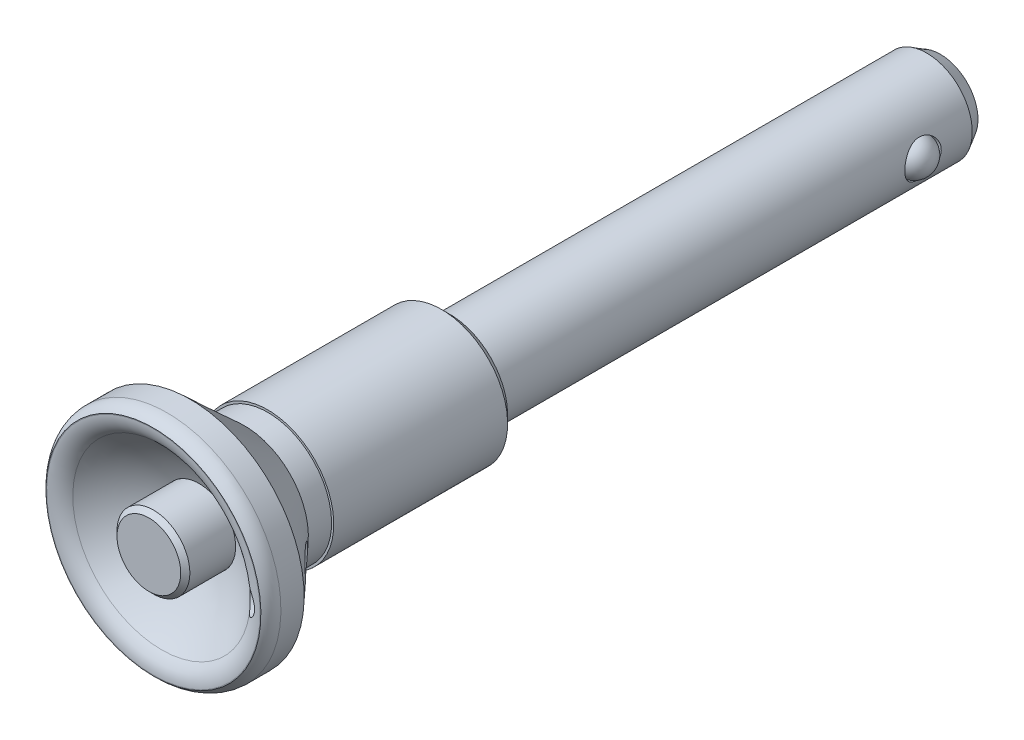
ISO-10303-21;
HEADER;
FILE_DESCRIPTION(('STEP AP214'),'2;1');
FILE_NAME('part.step','',(''),(''),'','','');
FILE_SCHEMA(('AUTOMOTIVE_DESIGN { 1 0 10303 214 1 1 1 1 }'));
ENDSEC;
DATA;
#1=APPLICATION_CONTEXT('core data for automotive mechanical design processes');
#2=APPLICATION_PROTOCOL_DEFINITION('international standard','automotive_design',2000,#1);
#3=PRODUCT_CONTEXT('',#1,'mechanical');
#4=PRODUCT('Part','Part','',(#3));
#5=PRODUCT_RELATED_PRODUCT_CATEGORY('part','',(#4));
#6=PRODUCT_DEFINITION_FORMATION('','',#4);
#7=PRODUCT_DEFINITION_CONTEXT('part definition',#1,'design');
#8=PRODUCT_DEFINITION('design','',#6,#7);
#9=PRODUCT_DEFINITION_SHAPE('','',#8);
#10=(LENGTH_UNIT() NAMED_UNIT(*) SI_UNIT(.MILLI.,.METRE.));
#11=(NAMED_UNIT(*) PLANE_ANGLE_UNIT() SI_UNIT($,.RADIAN.));
#12=(NAMED_UNIT(*) SI_UNIT($,.STERADIAN.) SOLID_ANGLE_UNIT());
#13=UNCERTAINTY_MEASURE_WITH_UNIT(LENGTH_MEASURE(1.E-05),#10,'distance_accuracy_value','');
#14=(GEOMETRIC_REPRESENTATION_CONTEXT(3) GLOBAL_UNCERTAINTY_ASSIGNED_CONTEXT((#13)) GLOBAL_UNIT_ASSIGNED_CONTEXT((#10,
#11,#12)) REPRESENTATION_CONTEXT('',''));
#15=CARTESIAN_POINT('',(0.,0.,0.));
#16=DIRECTION('',(0.,0.,1.));
#17=DIRECTION('',(1.,0.,0.));
#18=AXIS2_PLACEMENT_3D('',#15,#16,#17);
#19=CARTESIAN_POINT('',(0.,0.,-53.9));
#20=DIRECTION('',(0.,0.,-1.));
#21=DIRECTION('',(0.,1.,0.));
#22=AXIS2_PLACEMENT_3D('',#19,#20,#21);
#23=CYLINDRICAL_SURFACE('',#22,2.);
#24=CARTESIAN_POINT('',(0.,0.,-49.9));
#25=DIRECTION('',(0.,0.,-1.));
#26=DIRECTION('',(0.,1.,0.));
#27=AXIS2_PLACEMENT_3D('',#24,#25,#26);
#28=CIRCLE('',#27,2.);
#29=CARTESIAN_POINT('',(0.,2.,-49.9));
#30=VERTEX_POINT('',#29);
#31=EDGE_CURVE('E9',#30,#30,#28,.T.);
#32=ORIENTED_EDGE('',*,*,#31,.F.);
#33=EDGE_LOOP('',(#32));
#34=FACE_BOUND('',#33,.T.);
#35=CARTESIAN_POINT('',(0.,0.,-53.9));
#36=DIRECTION('',(0.,0.,-1.));
#37=DIRECTION('',(0.,1.,0.));
#38=AXIS2_PLACEMENT_3D('',#35,#36,#37);
#39=CIRCLE('',#38,2.);
#40=CARTESIAN_POINT('',(0.,2.,-53.9));
#41=VERTEX_POINT('',#40);
#42=EDGE_CURVE('E430',#41,#41,#39,.T.);
#43=ORIENTED_EDGE('',*,*,#42,.T.);
#44=EDGE_LOOP('',(#43));
#45=FACE_BOUND('',#44,.T.);
#46=ADVANCED_FACE('F14',(#34,#45),#23,.F.);
#47=CARTESIAN_POINT('',(0.,0.,-53.9));
#48=DIRECTION('',(0.,0.,-1.));
#49=DIRECTION('',(0.,1.,0.));
#50=AXIS2_PLACEMENT_3D('',#47,#48,#49);
#51=CYLINDRICAL_SURFACE('',#50,5.);
#52=CARTESIAN_POINT('',(4.58257569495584,2.,-47.));
#53=CARTESIAN_POINT('',(4.58258022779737,1.99999540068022,-47.107123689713));
#54=CARTESIAN_POINT('',(4.58638433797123,1.99134173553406,-47.2144262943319));
#55=CARTESIAN_POINT('',(4.601110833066,1.95706710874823,-47.4259390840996));
#56=CARTESIAN_POINT('',(4.61205140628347,1.93140279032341,-47.5301406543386));
#57=CARTESIAN_POINT('',(4.63960410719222,1.86423554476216,-47.7320518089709));
#58=CARTESIAN_POINT('',(4.65619484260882,1.8227922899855,-47.8297842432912));
#59=CARTESIAN_POINT('',(4.69314677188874,1.72542013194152,-48.0168853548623));
#60=CARTESIAN_POINT('',(4.71350714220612,1.66949439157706,-48.1062558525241));
#61=CARTESIAN_POINT('',(4.75700861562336,1.54132201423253,-48.2792603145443));
#62=CARTESIAN_POINT('',(4.78023917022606,1.46837936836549,-48.3623563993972));
#63=CARTESIAN_POINT('',(4.82612457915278,1.30970909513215,-48.5155290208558));
#64=CARTESIAN_POINT('',(4.84877922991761,1.22397701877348,-48.5856010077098));
#65=CARTESIAN_POINT('',(4.89203407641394,1.03800631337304,-48.7134063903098));
#66=CARTESIAN_POINT('',(4.9125180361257,0.937328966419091,-48.770544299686));
#67=CARTESIAN_POINT('',(4.94803927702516,0.726825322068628,-48.8668435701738));
#68=CARTESIAN_POINT('',(4.9630787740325,0.61700276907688,-48.9060122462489));
#69=CARTESIAN_POINT('',(4.98538324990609,0.396966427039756,-48.9633414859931));
#70=CARTESIAN_POINT('',(4.99298936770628,0.287028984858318,-48.9824273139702));
#71=CARTESIAN_POINT('',(5.0008031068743,0.0652663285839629,-49.0020284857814));
#72=CARTESIAN_POINT('',(5.00101348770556,-0.0465581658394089,-49.0025507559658));
#73=CARTESIAN_POINT('',(4.99421962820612,-0.262232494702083,-48.9855172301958));
#74=CARTESIAN_POINT('',(4.98761996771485,-0.366177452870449,-48.9689752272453));
#75=CARTESIAN_POINT('',(4.96849291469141,-0.569673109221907,-48.920007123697));
#76=CARTESIAN_POINT('',(4.95596508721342,-0.669223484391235,-48.8875798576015));
#77=CARTESIAN_POINT('',(4.92596824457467,-0.862897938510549,-48.8073635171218));
#78=CARTESIAN_POINT('',(4.90842760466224,-0.956917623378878,-48.7593502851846));
#79=CARTESIAN_POINT('',(4.87014585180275,-1.1358081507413,-48.6495349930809));
#80=CARTESIAN_POINT('',(4.84940364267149,-1.22067584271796,-48.5877282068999));
#81=CARTESIAN_POINT('',(4.80521637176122,-1.38476882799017,-48.4473508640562));
#82=CARTESIAN_POINT('',(4.78168326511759,-1.4632578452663,-48.3679461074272));
#83=CARTESIAN_POINT('',(4.73561660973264,-1.60610741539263,-48.197009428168));
#84=CARTESIAN_POINT('',(4.71308339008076,-1.67046334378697,-48.1054735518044));
#85=CARTESIAN_POINT('',(4.67096897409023,-1.78490418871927,-47.9095809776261));
#86=CARTESIAN_POINT('',(4.65148914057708,-1.83453465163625,-47.8049351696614));
#87=CARTESIAN_POINT('',(4.61887590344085,-1.91517625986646,-47.5877845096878));
#88=CARTESIAN_POINT('',(4.60573837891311,-1.94619949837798,-47.4752848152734));
#89=CARTESIAN_POINT('',(4.58829759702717,-1.9869549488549,-47.2529642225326));
#90=CARTESIAN_POINT('',(4.58350366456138,-1.99787209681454,-47.1433995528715));
#91=CARTESIAN_POINT('',(4.58189497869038,-2.00156132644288,-46.9239227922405));
#92=CARTESIAN_POINT('',(4.58507780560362,-1.99433891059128,-46.8140108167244));
#93=CARTESIAN_POINT('',(4.59856044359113,-1.96303289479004,-46.6035410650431));
#94=CARTESIAN_POINT('',(4.608444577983,-1.93993306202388,-46.5028070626));
#95=CARTESIAN_POINT('',(4.63370051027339,-1.87880418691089,-46.3067115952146));
#96=CARTESIAN_POINT('',(4.64907352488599,-1.84077183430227,-46.2113513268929));
#97=CARTESIAN_POINT('',(4.68433781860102,-1.74913563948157,-46.0243976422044));
#98=CARTESIAN_POINT('',(4.70438704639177,-1.69496286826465,-45.9331138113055));
#99=CARTESIAN_POINT('',(4.74650385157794,-1.57316522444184,-45.7605170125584));
#100=CARTESIAN_POINT('',(4.76857224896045,-1.5055348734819,-45.6792081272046));
#101=CARTESIAN_POINT('',(4.81420915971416,-1.35284421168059,-45.5226265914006));
#102=CARTESIAN_POINT('',(4.83776807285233,-1.26686542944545,-45.4482434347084));
#103=CARTESIAN_POINT('',(4.88219794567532,-1.08308363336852,-45.3148229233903));
#104=CARTESIAN_POINT('',(4.90306879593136,-0.985280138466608,-45.255786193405));
#105=CARTESIAN_POINT('',(4.9398371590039,-0.780279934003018,-45.1549523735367));
#106=CARTESIAN_POINT('',(4.9557358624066,-0.673085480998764,-45.1131511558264));
#107=CARTESIAN_POINT('',(4.98072713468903,-0.452393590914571,-45.0484511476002));
#108=CARTESIAN_POINT('',(4.98982339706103,-0.33889961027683,-45.0255420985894));
#109=CARTESIAN_POINT('',(4.99979008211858,-0.116816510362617,-45.0004952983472));
#110=CARTESIAN_POINT('',(5.00115846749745,-0.00839049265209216,-44.997099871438));
#111=CARTESIAN_POINT('',(4.99686042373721,0.207433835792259,-45.0078554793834));
#112=CARTESIAN_POINT('',(4.99119505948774,0.314832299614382,-45.0220038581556));
#113=CARTESIAN_POINT('',(4.97371513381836,0.522170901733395,-45.0665467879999));
#114=CARTESIAN_POINT('',(4.96209480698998,0.622238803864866,-45.0964289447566));
#115=CARTESIAN_POINT('',(4.93394947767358,0.815922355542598,-45.1710528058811));
#116=CARTESIAN_POINT('',(4.91742357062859,0.909536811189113,-45.2157972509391));
#117=CARTESIAN_POINT('',(4.88018094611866,1.09220303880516,-45.3211031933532));
#118=CARTESIAN_POINT('',(4.85931130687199,1.1808703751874,-45.3822762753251));
#119=CARTESIAN_POINT('',(4.8158940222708,1.34705404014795,-45.517788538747));
#120=CARTESIAN_POINT('',(4.79334568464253,1.42456572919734,-45.5921331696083));
#121=CARTESIAN_POINT('',(4.74737767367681,1.57120121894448,-45.7573151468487));
#122=CARTESIAN_POINT('',(4.72399047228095,1.63950871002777,-45.8488885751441));
#123=CARTESIAN_POINT('',(4.68049656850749,1.75984762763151,-46.0429424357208));
#124=CARTESIAN_POINT('',(4.66039025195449,1.81187714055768,-46.1454241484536));
#125=CARTESIAN_POINT('',(4.62758914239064,1.89399048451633,-46.3490361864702));
#126=CARTESIAN_POINT('',(4.61439096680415,1.92562535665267,-46.4494616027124));
#127=CARTESIAN_POINT('',(4.5944582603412,1.97271990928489,-46.6544890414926));
#128=CARTESIAN_POINT('',(4.58770572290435,1.98822466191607,-46.7590785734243));
#129=CARTESIAN_POINT('',(4.5839176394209,1.99692202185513,-46.8867782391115));
#130=CARTESIAN_POINT('',(4.58341531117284,1.99807530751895,-46.9094014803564));
#131=CARTESIAN_POINT('',(4.58274384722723,1.9996148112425,-46.9546804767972));
#132=CARTESIAN_POINT('',(4.5825747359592,2.0000009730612,-46.9773362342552));
#133=CARTESIAN_POINT('',(4.58257569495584,2.,-47.));
#134=B_SPLINE_CURVE_WITH_KNOTS('',3,(#52,#53,#54,#55,#56,#57,#58,#59,#60,#61,#62,#63,#64,#65,
#66,#67,#68,#69,#70,#71,#72,#73,#74,#75,#76,#77,#78,#79,#80,#81,#82,#83,#84,#85,#86,#87,#88,#89,
#90,#91,#92,#93,#94,#95,#96,#97,#98,#99,#100,#101,#102,#103,#104,#105,#106,#107,#108,#109,#110,
#111,#112,#113,#114,#115,#116,#117,#118,#119,#120,#121,#122,#123,#124,#125,#126,#127,#128,#129,
#130,#131,#132,#133),.UNSPECIFIED.,.T.,.F.,(4,2,2,2,2,2,2,2,2,2,2,2,2,2,2,2,2,2,2,2,2,2,2,2,2,2,
2,2,2,2,2,2,2,2,2,2,2,2,2,2,4),(0.,0.321277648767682,0.643377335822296,0.964270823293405,
1.2850942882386,1.62255618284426,1.96013574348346,2.3110266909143,2.66177466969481,
2.99554182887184,3.32918445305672,3.64408644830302,3.95901155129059,4.27868300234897,
4.59846414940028,4.93924044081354,5.28012807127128,5.63064458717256,5.98093304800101,
6.30982147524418,6.63861014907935,6.9486724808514,7.25880358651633,7.581511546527,
7.90435114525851,8.25103734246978,8.59773764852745,8.9443548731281,9.29078375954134,
9.61461039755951,9.938388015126,10.2522199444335,10.5661097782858,10.8938705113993,
11.2217671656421,11.5699625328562,11.9181988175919,12.2351666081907,12.5512463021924,
12.619212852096,12.6871843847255),.UNSPECIFIED.);
#135=CARTESIAN_POINT('',(4.58257569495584,2.,-47.));
#136=VERTEX_POINT('',#135);
#137=EDGE_CURVE('E414',#136,#136,#134,.T.);
#138=ORIENTED_EDGE('',*,*,#137,.T.);
#139=EDGE_LOOP('',(#138));
#140=FACE_BOUND('',#139,.T.);
#141=CARTESIAN_POINT('',(0.,0.,-52.4));
#142=DIRECTION('',(0.,0.,-1.));
#143=DIRECTION('',(0.,1.,0.));
#144=AXIS2_PLACEMENT_3D('',#141,#142,#143);
#145=CIRCLE('',#144,5.);
#146=CARTESIAN_POINT('',(0.,5.,-52.4));
#147=VERTEX_POINT('',#146);
#148=EDGE_CURVE('E67',#147,#147,#145,.T.);
#149=ORIENTED_EDGE('',*,*,#148,.F.);
#150=EDGE_LOOP('',(#149));
#151=FACE_BOUND('',#150,.T.);
#152=CARTESIAN_POINT('',(-4.58257569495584,2.,-47.));
#153=CARTESIAN_POINT('',(-4.58258022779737,1.99999540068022,-46.8928763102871));
#154=CARTESIAN_POINT('',(-4.58638433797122,1.99134173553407,-46.7855737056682));
#155=CARTESIAN_POINT('',(-4.601110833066,1.95706710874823,-46.5740609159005));
#156=CARTESIAN_POINT('',(-4.61205140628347,1.9314027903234,-46.4698593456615));
#157=CARTESIAN_POINT('',(-4.63960410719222,1.86423554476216,-46.2679481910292));
#158=CARTESIAN_POINT('',(-4.65619484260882,1.82279228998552,-46.1702157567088));
#159=CARTESIAN_POINT('',(-4.69314677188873,1.72542013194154,-45.9831146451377));
#160=CARTESIAN_POINT('',(-4.71350714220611,1.66949439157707,-45.8937441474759));
#161=CARTESIAN_POINT('',(-4.75700861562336,1.54132201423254,-45.7207396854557));
#162=CARTESIAN_POINT('',(-4.78023917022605,1.46837936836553,-45.6376436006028));
#163=CARTESIAN_POINT('',(-4.82612457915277,1.30970909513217,-45.4844709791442));
#164=CARTESIAN_POINT('',(-4.84877922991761,1.22397701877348,-45.4143989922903));
#165=CARTESIAN_POINT('',(-4.89203407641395,1.03800631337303,-45.2865936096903));
#166=CARTESIAN_POINT('',(-4.9125180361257,0.937328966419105,-45.2294557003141));
#167=CARTESIAN_POINT('',(-4.94803927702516,0.726825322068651,-45.1331564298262));
#168=CARTESIAN_POINT('',(-4.96307877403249,0.617002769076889,-45.0939877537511));
#169=CARTESIAN_POINT('',(-4.98538324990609,0.396966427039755,-45.0366585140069));
#170=CARTESIAN_POINT('',(-4.99298936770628,0.287028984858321,-45.0175726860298));
#171=CARTESIAN_POINT('',(-5.0008031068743,0.0652663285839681,-44.9979715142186));
#172=CARTESIAN_POINT('',(-5.00101348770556,-0.0465581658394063,-44.9974492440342));
#173=CARTESIAN_POINT('',(-4.99421962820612,-0.262232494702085,-45.0144827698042));
#174=CARTESIAN_POINT('',(-4.98761996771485,-0.366177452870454,-45.0310247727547));
#175=CARTESIAN_POINT('',(-4.96849291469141,-0.56967310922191,-45.079992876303));
#176=CARTESIAN_POINT('',(-4.95596508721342,-0.669223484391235,-45.1124201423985));
#177=CARTESIAN_POINT('',(-4.92596824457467,-0.862897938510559,-45.1926364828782));
#178=CARTESIAN_POINT('',(-4.90842760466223,-0.956917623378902,-45.2406497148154));
#179=CARTESIAN_POINT('',(-4.87014585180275,-1.13580815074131,-45.3504650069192));
#180=CARTESIAN_POINT('',(-4.84940364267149,-1.22067584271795,-45.4122717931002));
#181=CARTESIAN_POINT('',(-4.80521637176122,-1.38476882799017,-45.5526491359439));
#182=CARTESIAN_POINT('',(-4.78168326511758,-1.46325784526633,-45.6320538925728));
#183=CARTESIAN_POINT('',(-4.73561660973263,-1.60610741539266,-45.802990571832));
#184=CARTESIAN_POINT('',(-4.71308339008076,-1.67046334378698,-45.8945264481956));
#185=CARTESIAN_POINT('',(-4.67096897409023,-1.78490418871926,-46.0904190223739));
#186=CARTESIAN_POINT('',(-4.65148914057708,-1.83453465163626,-46.1950648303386));
#187=CARTESIAN_POINT('',(-4.61887590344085,-1.91517625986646,-46.4122154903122));
#188=CARTESIAN_POINT('',(-4.60573837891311,-1.94619949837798,-46.5247151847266));
#189=CARTESIAN_POINT('',(-4.58829759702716,-1.9869549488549,-46.7470357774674));
#190=CARTESIAN_POINT('',(-4.58350366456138,-1.99787209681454,-46.8566004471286));
#191=CARTESIAN_POINT('',(-4.58189497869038,-2.00156132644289,-47.0760772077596));
#192=CARTESIAN_POINT('',(-4.58507780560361,-1.99433891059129,-47.1859891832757));
#193=CARTESIAN_POINT('',(-4.59856044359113,-1.96303289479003,-47.396458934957));
#194=CARTESIAN_POINT('',(-4.60844457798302,-1.93993306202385,-47.4971929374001));
#195=CARTESIAN_POINT('',(-4.63370051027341,-1.87880418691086,-47.6932884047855));
#196=CARTESIAN_POINT('',(-4.64907352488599,-1.84077183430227,-47.7886486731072));
#197=CARTESIAN_POINT('',(-4.68433781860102,-1.74913563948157,-47.9756023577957));
#198=CARTESIAN_POINT('',(-4.70438704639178,-1.69496286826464,-48.0668861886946));
#199=CARTESIAN_POINT('',(-4.74650385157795,-1.57316522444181,-48.2394829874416));
#200=CARTESIAN_POINT('',(-4.76857224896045,-1.50553487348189,-48.3207918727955));
#201=CARTESIAN_POINT('',(-4.81420915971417,-1.35284421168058,-48.4773734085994));
#202=CARTESIAN_POINT('',(-4.83776807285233,-1.26686542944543,-48.5517565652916));
#203=CARTESIAN_POINT('',(-4.88219794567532,-1.0830836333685,-48.6851770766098));
#204=CARTESIAN_POINT('',(-4.90306879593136,-0.985280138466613,-48.7442138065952));
#205=CARTESIAN_POINT('',(-4.9398371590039,-0.78027993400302,-48.8450476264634));
#206=CARTESIAN_POINT('',(-4.9557358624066,-0.673085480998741,-48.8868488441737));
#207=CARTESIAN_POINT('',(-4.98072713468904,-0.452393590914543,-48.9515488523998));
#208=CARTESIAN_POINT('',(-4.98982339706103,-0.338899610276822,-48.9744579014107));
#209=CARTESIAN_POINT('',(-4.99979008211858,-0.116816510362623,-48.9995047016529));
#210=CARTESIAN_POINT('',(-5.00115846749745,-0.00839049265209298,-49.002900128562));
#211=CARTESIAN_POINT('',(-4.99686042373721,0.207433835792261,-48.9921445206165));
#212=CARTESIAN_POINT('',(-4.99119505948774,0.314832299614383,-48.9779961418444));
#213=CARTESIAN_POINT('',(-4.97371513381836,0.522170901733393,-48.9334532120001));
#214=CARTESIAN_POINT('',(-4.96209480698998,0.622238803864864,-48.9035710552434));
#215=CARTESIAN_POINT('',(-4.93394947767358,0.815922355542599,-48.8289471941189));
#216=CARTESIAN_POINT('',(-4.91742357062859,0.909536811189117,-48.7842027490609));
#217=CARTESIAN_POINT('',(-4.88018094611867,1.09220303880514,-48.6788968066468));
#218=CARTESIAN_POINT('',(-4.859311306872,1.18087037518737,-48.6177237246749));
#219=CARTESIAN_POINT('',(-4.8158940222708,1.34705404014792,-48.482211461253));
#220=CARTESIAN_POINT('',(-4.79334568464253,1.42456572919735,-48.4078668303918));
#221=CARTESIAN_POINT('',(-4.74737767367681,1.57120121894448,-48.2426848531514));
#222=CARTESIAN_POINT('',(-4.72399047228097,1.63950871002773,-48.1511114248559));
#223=CARTESIAN_POINT('',(-4.6804965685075,1.75984762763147,-47.9570575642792));
#224=CARTESIAN_POINT('',(-4.66039025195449,1.81187714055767,-47.8545758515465));
#225=CARTESIAN_POINT('',(-4.62758914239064,1.89399048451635,-47.6509638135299));
#226=CARTESIAN_POINT('',(-4.61439096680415,1.92562535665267,-47.5505383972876));
#227=CARTESIAN_POINT('',(-4.5944582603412,1.97271990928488,-47.3455109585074));
#228=CARTESIAN_POINT('',(-4.58770572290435,1.98822466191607,-47.2409214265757));
#229=CARTESIAN_POINT('',(-4.5839176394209,1.99692202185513,-47.1132217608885));
#230=CARTESIAN_POINT('',(-4.58341531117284,1.99807530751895,-47.0905985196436));
#231=CARTESIAN_POINT('',(-4.58274384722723,1.9996148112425,-47.0453195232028));
#232=CARTESIAN_POINT('',(-4.5825747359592,2.0000009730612,-47.0226637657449));
#233=CARTESIAN_POINT('',(-4.58257569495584,2.,-47.));
#234=B_SPLINE_CURVE_WITH_KNOTS('',3,(#152,#153,#154,#155,#156,#157,#158,#159,#160,#161,#162,
#163,#164,#165,#166,#167,#168,#169,#170,#171,#172,#173,#174,#175,#176,#177,#178,#179,#180,#181,
#182,#183,#184,#185,#186,#187,#188,#189,#190,#191,#192,#193,#194,#195,#196,#197,#198,#199,#200,
#201,#202,#203,#204,#205,#206,#207,#208,#209,#210,#211,#212,#213,#214,#215,#216,#217,#218,#219,
#220,#221,#222,#223,#224,#225,#226,#227,#228,#229,#230,#231,#232,#233),.UNSPECIFIED.,.T.,.F.,(4,
2,2,2,2,2,2,2,2,2,2,2,2,2,2,2,2,2,2,2,2,2,2,2,2,2,2,2,2,2,2,2,2,2,2,2,2,2,2,2,4),(0.,
0.321277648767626,0.643377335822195,0.964270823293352,1.28509428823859,1.62255618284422,
1.96013574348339,2.31102669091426,2.66177466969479,2.99554182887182,3.3291844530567,
3.64408644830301,3.95901155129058,4.27868300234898,4.59846414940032,4.93924044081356,
5.28012807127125,5.63064458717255,5.98093304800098,6.30982147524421,6.63861014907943,
6.94867248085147,7.25880358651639,7.58151154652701,7.90435114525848,8.25103734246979,
8.59773764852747,8.94435487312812,9.29078375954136,9.61461039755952,9.93838801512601,
10.2522199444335,10.5661097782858,10.8938705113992,11.221767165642,11.5699625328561,
11.9181988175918,12.2351666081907,12.5512463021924,12.619212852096,12.6871843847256),.UNSPECIFIED.);
#235=CARTESIAN_POINT('',(-4.58257569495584,2.,-47.));
#236=VERTEX_POINT('',#235);
#237=EDGE_CURVE('E61',#236,#236,#234,.T.);
#238=ORIENTED_EDGE('',*,*,#237,.T.);
#239=EDGE_LOOP('',(#238));
#240=FACE_BOUND('',#239,.T.);
#241=CARTESIAN_POINT('',(0.,0.,0.));
#242=DIRECTION('',(0.,0.,1.));
#243=DIRECTION('',(1.,0.,0.));
#244=AXIS2_PLACEMENT_3D('',#241,#242,#243);
#245=CIRCLE('',#244,5.);
#246=CARTESIAN_POINT('',(5.,0.,0.));
#247=VERTEX_POINT('',#246);
#248=EDGE_CURVE('E73',#247,#247,#245,.T.);
#249=ORIENTED_EDGE('',*,*,#248,.F.);
#250=EDGE_LOOP('',(#249));
#251=FACE_BOUND('',#250,.T.);
#252=ADVANCED_FACE('F384',(#140,#151,#240,#251),#51,.T.);
#253=CARTESIAN_POINT('',(2.,0.,-53.9));
#254=DIRECTION('',(0.,0.,-1.));
#255=DIRECTION('',(0.,1.,0.));
#256=AXIS2_PLACEMENT_3D('',#253,#254,#255);
#257=PLANE('',#256);
#258=CARTESIAN_POINT('',(0.,0.,-53.9));
#259=DIRECTION('',(0.,0.,-1.));
#260=DIRECTION('',(0.,1.,0.));
#261=AXIS2_PLACEMENT_3D('',#258,#259,#260);
#262=CIRCLE('',#261,4.13397459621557);
#263=CARTESIAN_POINT('',(0.,4.13397459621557,-53.9));
#264=VERTEX_POINT('',#263);
#265=EDGE_CURVE('E433',#264,#264,#262,.T.);
#266=ORIENTED_EDGE('',*,*,#265,.T.);
#267=EDGE_LOOP('',(#266));
#268=FACE_BOUND('',#267,.T.);
#269=ORIENTED_EDGE('',*,*,#42,.F.);
#270=EDGE_LOOP('',(#269));
#271=FACE_BOUND('',#270,.T.);
#272=ADVANCED_FACE('F374',(#268,#271),#257,.T.);
#273=CARTESIAN_POINT('',(0.,0.,-53.9));
#274=DIRECTION('',(0.,0.,1.));
#275=DIRECTION('',(0.,-1.,0.));
#276=AXIS2_PLACEMENT_3D('',#273,#274,#275);
#277=CONICAL_SURFACE('',#276,4.13397459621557,0.523598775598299);
#278=ORIENTED_EDGE('',*,*,#148,.T.);
#279=EDGE_LOOP('',(#278));
#280=FACE_BOUND('',#279,.T.);
#281=ORIENTED_EDGE('',*,*,#265,.F.);
#282=EDGE_LOOP('',(#281));
#283=FACE_BOUND('',#282,.T.);
#284=ADVANCED_FACE('F366',(#280,#283),#277,.T.);
#285=CARTESIAN_POINT('',(6.,0.,-47.));
#286=DIRECTION('',(1.,0.,0.));
#287=DIRECTION('',(0.,1.,0.));
#288=AXIS2_PLACEMENT_3D('',#285,#286,#287);
#289=CYLINDRICAL_SURFACE('',#288,2.);
#290=CARTESIAN_POINT('',(3.69295257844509,2.,-47.));
#291=CARTESIAN_POINT('',(3.69296124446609,1.99999252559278,-46.8950365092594));
#292=CARTESIAN_POINT('',(3.69749476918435,1.99168229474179,-46.7899198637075));
#293=CARTESIAN_POINT('',(3.71499510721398,1.95883523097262,-46.5828549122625));
#294=CARTESIAN_POINT('',(3.7279812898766,1.93426112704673,-46.4809144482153));
#295=CARTESIAN_POINT('',(3.76054820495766,1.87014699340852,-46.2835779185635));
#296=CARTESIAN_POINT('',(3.78009636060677,1.83068077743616,-46.1881522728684));
#297=CARTESIAN_POINT('',(3.82353505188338,1.73812635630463,-46.0052997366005));
#298=CARTESIAN_POINT('',(3.84742546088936,1.68503854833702,-45.9178726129));
#299=CARTESIAN_POINT('',(3.89903612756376,1.56210627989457,-45.7462961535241));
#300=CARTESIAN_POINT('',(3.92690909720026,1.49130855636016,-45.6628754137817));
#301=CARTESIAN_POINT('',(3.98210623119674,1.3369544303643,-45.5085333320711));
#302=CARTESIAN_POINT('',(4.00943013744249,1.25339217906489,-45.4376177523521));
#303=CARTESIAN_POINT('',(4.0624063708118,1.06976932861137,-45.3061632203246));
#304=CARTESIAN_POINT('',(4.08786122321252,0.969021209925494,-45.2464976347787));
#305=CARTESIAN_POINT('',(4.1322840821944,0.757479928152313,-45.1452903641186));
#306=CARTESIAN_POINT('',(4.15125580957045,0.646692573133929,-45.1037382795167));
#307=CARTESIAN_POINT('',(4.17948005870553,0.42591716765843,-45.0427479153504));
#308=CARTESIAN_POINT('',(4.18928822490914,0.316352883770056,-45.0220384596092));
#309=CARTESIAN_POINT('',(4.20013773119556,0.0948978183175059,-44.9991585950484));
#310=CARTESIAN_POINT('',(4.20118382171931,-0.0169916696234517,-44.996978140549));
#311=CARTESIAN_POINT('',(4.1946744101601,-0.230460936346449,-45.0106738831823));
#312=CARTESIAN_POINT('',(4.18779244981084,-0.332156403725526,-45.0251360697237));
#313=CARTESIAN_POINT('',(4.1671904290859,-0.53147319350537,-45.0692085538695));
#314=CARTESIAN_POINT('',(4.15346986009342,-0.629094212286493,-45.0988199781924));
#315=CARTESIAN_POINT('',(4.12021451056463,-0.819264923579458,-45.1726068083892));
#316=CARTESIAN_POINT('',(4.10059733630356,-0.911719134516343,-45.2169896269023));
#317=CARTESIAN_POINT('',(4.05736238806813,-1.08810289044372,-45.3188060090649));
#318=CARTESIAN_POINT('',(4.03374315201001,-1.17202930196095,-45.376244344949));
#319=CARTESIAN_POINT('',(3.98232079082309,-1.33682830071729,-45.508356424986));
#320=CARTESIAN_POINT('',(3.95433239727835,-1.41678585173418,-45.5841006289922));
#321=CARTESIAN_POINT('',(3.89872441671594,-1.5633305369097,-45.7477715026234));
#322=CARTESIAN_POINT('',(3.87110507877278,-1.62990902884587,-45.8357059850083));
#323=CARTESIAN_POINT('',(3.81780436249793,-1.75125633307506,-46.0270633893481));
#324=CARTESIAN_POINT('',(3.79230552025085,-1.8052035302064,-46.1310630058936));
#325=CARTESIAN_POINT('',(3.74853610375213,-1.8944319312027,-46.348181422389));
#326=CARTESIAN_POINT('',(3.73025862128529,-1.92973098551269,-46.4612913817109));
#327=CARTESIAN_POINT('',(3.70489726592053,-1.97796079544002,-46.6842923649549));
#328=CARTESIAN_POINT('',(3.69706613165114,-1.99239193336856,-46.7937711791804));
#329=CARTESIAN_POINT('',(3.69134421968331,-2.00297881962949,-47.013842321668));
#330=CARTESIAN_POINT('',(3.69344777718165,-1.99914498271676,-47.1244339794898));
#331=CARTESIAN_POINT('',(3.70656984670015,-1.97468704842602,-47.3324720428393));
#332=CARTESIAN_POINT('',(3.71672580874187,-1.95568631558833,-47.4301719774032));
#333=CARTESIAN_POINT('',(3.74358473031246,-1.90376463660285,-47.6208457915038));
#334=CARTESIAN_POINT('',(3.76028958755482,-1.87083965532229,-47.7138182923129));
#335=CARTESIAN_POINT('',(3.79928393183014,-1.79036865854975,-47.8972604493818));
#336=CARTESIAN_POINT('',(3.82179608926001,-1.7422165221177,-47.9874151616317));
#337=CARTESIAN_POINT('',(3.86963561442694,-1.63320542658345,-48.1588668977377));
#338=CARTESIAN_POINT('',(3.89496439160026,-1.5723400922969,-48.2401594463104));
#339=CARTESIAN_POINT('',(3.94900124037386,-1.4316339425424,-48.4011030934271));
#340=CARTESIAN_POINT('',(3.97776977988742,-1.3504306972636,-48.4795481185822));
#341=CARTESIAN_POINT('',(4.03293385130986,-1.17547949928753,-48.6220285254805));
#342=CARTESIAN_POINT('',(4.05932880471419,-1.08172850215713,-48.6860604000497));
#343=CARTESIAN_POINT('',(4.10741012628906,-0.881934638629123,-48.7987682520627));
#344=CARTESIAN_POINT('',(4.1290048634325,-0.775703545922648,-48.8471523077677));
#345=CARTESIAN_POINT('',(4.16436909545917,-0.555289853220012,-48.9249103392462));
#346=CARTESIAN_POINT('',(4.17814481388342,-0.441113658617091,-48.9542994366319));
#347=CARTESIAN_POINT('',(4.19540926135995,-0.218647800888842,-48.9909275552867));
#348=CARTESIAN_POINT('',(4.19968035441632,-0.110695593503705,-48.9998531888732));
#349=CARTESIAN_POINT('',(4.1998175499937,0.105223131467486,-49.0001430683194));
#350=CARTESIAN_POINT('',(4.19568607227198,0.213189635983,-48.9915123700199));
#351=CARTESIAN_POINT('',(4.17993566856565,0.419731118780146,-48.9581010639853));
#352=CARTESIAN_POINT('',(4.168749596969,0.518493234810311,-48.9342532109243));
#353=CARTESIAN_POINT('',(4.1403533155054,0.710491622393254,-48.872267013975));
#354=CARTESIAN_POINT('',(4.12314216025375,0.803727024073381,-48.8341264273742));
#355=CARTESIAN_POINT('',(4.08331986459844,0.986690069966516,-48.7428034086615));
#356=CARTESIAN_POINT('',(4.06050114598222,1.07607281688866,-48.6890230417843));
#357=CARTESIAN_POINT('',(4.01195381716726,1.24493254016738,-48.5687268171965));
#358=CARTESIAN_POINT('',(3.98622388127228,1.32440496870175,-48.5022051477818));
#359=CARTESIAN_POINT('',(3.9317186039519,1.47877758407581,-48.3512584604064));
#360=CARTESIAN_POINT('',(3.90287905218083,1.55260530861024,-48.2657556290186));
#361=CARTESIAN_POINT('',(3.8474945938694,1.68518766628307,-48.0830092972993));
#362=CARTESIAN_POINT('',(3.82095142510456,1.74393094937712,-47.9857570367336));
#363=CARTESIAN_POINT('',(3.77299479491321,1.84543916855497,-47.7795828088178));
#364=CARTESIAN_POINT('',(3.75168341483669,1.88789405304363,-47.6704807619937));
#365=CARTESIAN_POINT('',(3.72647961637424,1.93689798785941,-47.5018569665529));
#366=CARTESIAN_POINT('',(3.71920915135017,1.95078018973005,-47.4448752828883));
#367=CARTESIAN_POINT('',(3.7071973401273,1.97351358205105,-47.3296687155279));
#368=CARTESIAN_POINT('',(3.7024541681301,1.98236840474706,-47.2714447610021));
#369=CARTESIAN_POINT('',(3.69705078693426,1.99241849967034,-47.1775698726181));
#370=CARTESIAN_POINT('',(3.69551719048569,1.99525904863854,-47.1421353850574));
#371=CARTESIAN_POINT('',(3.69346659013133,1.99905111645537,-47.0711398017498));
#372=CARTESIAN_POINT('',(3.69294964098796,2.00000253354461,-47.035578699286));
#373=CARTESIAN_POINT('',(3.69295257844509,2.,-47.));
#374=B_SPLINE_CURVE_WITH_KNOTS('',3,(#290,#291,#292,#293,#294,#295,#296,#297,#298,#299,#300,
#301,#302,#303,#304,#305,#306,#307,#308,#309,#310,#311,#312,#313,#314,#315,#316,#317,#318,#319,
#320,#321,#322,#323,#324,#325,#326,#327,#328,#329,#330,#331,#332,#333,#334,#335,#336,#337,#338,
#339,#340,#341,#342,#343,#344,#345,#346,#347,#348,#349,#350,#351,#352,#353,#354,#355,#356,#357,
#358,#359,#360,#361,#362,#363,#364,#365,#366,#367,#368,#369,#370,#371,#372,#373),.UNSPECIFIED.,
.T.,.F.,(4,2,2,2,2,2,2,2,2,2,2,2,2,2,2,2,2,2,2,2,2,2,2,2,2,2,2,2,2,2,2,2,2,2,2,2,2,2,2,2,2,4),
(0.,0.314747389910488,0.630218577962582,0.944146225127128,1.25806471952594,1.59535393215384,
1.93279816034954,2.29040808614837,2.64781242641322,2.98178553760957,3.31557757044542,
3.6229784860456,3.93040226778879,4.2423389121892,4.55438976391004,4.89383754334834,
5.23350388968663,5.59132862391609,5.94881021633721,6.27903319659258,6.60906790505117,
6.90786821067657,7.20675516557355,7.51947407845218,7.83235018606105,8.18030775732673,
8.52834990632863,8.88255362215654,9.23647501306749,9.55997846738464,9.88338877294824,
10.1886636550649,10.4939864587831,10.8130037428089,11.1321668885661,11.4803449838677,
11.8287842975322,12.1835611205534,12.3606240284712,12.5375588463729,12.6442406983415,
12.750928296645),.UNSPECIFIED.);
#375=CARTESIAN_POINT('',(3.85225966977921,1.67272059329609,-48.0963602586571));
#376=VERTEX_POINT('',#375);
#377=CARTESIAN_POINT('',(3.85225966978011,-1.67272059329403,-48.0963602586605));
#378=VERTEX_POINT('',#377);
#379=EDGE_CURVE('E63',#376,#378,#374,.T.);
#380=ORIENTED_EDGE('',*,*,#379,.F.);
#381=CARTESIAN_POINT('',(4.19974984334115,0.,-48.9999999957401));
#382=CARTESIAN_POINT('',(4.19974979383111,0.112133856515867,-48.9999951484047));
#383=CARTESIAN_POINT('',(4.19927754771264,0.224413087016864,-48.9905315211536));
#384=CARTESIAN_POINT('',(4.19737987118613,0.445943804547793,-48.9528961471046));
#385=CARTESIAN_POINT('',(4.19595246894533,0.555188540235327,-48.9246857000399));
#386=CARTESIAN_POINT('',(4.19212216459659,0.767313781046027,-48.8503623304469));
#387=CARTESIAN_POINT('',(4.18972003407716,0.870199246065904,-48.8042635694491));
#388=CARTESIAN_POINT('',(4.18389859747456,1.06670436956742,-48.6955084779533));
#389=CARTESIAN_POINT('',(4.18047981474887,1.16032876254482,-48.6328606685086));
#390=CARTESIAN_POINT('',(4.17254294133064,1.33575977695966,-48.4927659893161));
#391=CARTESIAN_POINT('',(4.16802447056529,1.41756229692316,-48.4153140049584));
#392=CARTESIAN_POINT('',(4.15774347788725,1.56703120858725,-48.2478047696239));
#393=CARTESIAN_POINT('',(4.15198042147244,1.63469150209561,-48.1577421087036));
#394=CARTESIAN_POINT('',(4.13889872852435,1.75400147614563,-47.9675249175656));
#395=CARTESIAN_POINT('',(4.13157812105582,1.80563066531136,-47.8673576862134));
#396=CARTESIAN_POINT('',(4.11478827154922,1.89126247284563,-47.6600522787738));
#397=CARTESIAN_POINT('',(4.10532235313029,1.92529209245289,-47.552925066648));
#398=CARTESIAN_POINT('',(4.08797788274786,1.96230917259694,-47.3903489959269));
#399=CARTESIAN_POINT('',(4.08173176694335,1.97228597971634,-47.3362647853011));
#400=CARTESIAN_POINT('',(4.06714094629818,1.98774141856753,-47.2278123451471));
#401=CARTESIAN_POINT('',(4.05879592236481,1.99321936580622,-47.1734440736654));
#402=CARTESIAN_POINT('',(4.04230132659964,1.99805364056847,-47.092140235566));
#403=CARTESIAN_POINT('',(4.0361535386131,1.99910232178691,-47.065124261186));
#404=CARTESIAN_POINT('',(4.02444072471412,1.99970372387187,-47.0347632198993));
#405=CARTESIAN_POINT('',(4.02250757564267,1.99977855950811,-47.030121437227));
#406=CARTESIAN_POINT('',(4.01814107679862,1.99989236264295,-47.0211873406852));
#407=CARTESIAN_POINT('',(4.0157234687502,1.99993228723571,-47.0168888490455));
#408=CARTESIAN_POINT('',(4.01208715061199,1.99996240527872,-47.0122892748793));
#409=CARTESIAN_POINT('',(4.01145667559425,1.99996683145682,-47.011541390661));
#410=CARTESIAN_POINT('',(4.01012709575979,1.99997459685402,-47.0101050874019));
#411=CARTESIAN_POINT('',(4.0094278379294,1.99997793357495,-47.0094168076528));
#412=CARTESIAN_POINT('',(4.0079377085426,1.99998361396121,-47.0081222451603));
#413=CARTESIAN_POINT('',(4.00714567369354,1.99998594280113,-47.0075172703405));
#414=CARTESIAN_POINT('',(4.00546606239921,1.99998963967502,-47.0064591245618));
#415=CARTESIAN_POINT('',(4.00457899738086,1.99999101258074,-47.0060051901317));
#416=CARTESIAN_POINT('',(4.00309539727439,1.99999254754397,-47.0054637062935));
#417=CARTESIAN_POINT('',(4.00252608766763,1.99999297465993,-47.0053022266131));
#418=CARTESIAN_POINT('',(4.00136845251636,1.99999355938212,-47.0050769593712));
#419=CARTESIAN_POINT('',(4.00078014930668,1.99999371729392,-47.0050130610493));
#420=CARTESIAN_POINT('',(3.99960008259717,1.99999377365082,-47.0049905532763));
#421=CARTESIAN_POINT('',(3.99900831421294,1.99999367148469,-47.0050321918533));
#422=CARTESIAN_POINT('',(3.99784054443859,1.99999320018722,-47.0052160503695));
#423=CARTESIAN_POINT('',(3.99726456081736,1.99999283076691,-47.0053583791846));
#424=CARTESIAN_POINT('',(3.99596613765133,1.99999164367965,-47.0057864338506));
#425=CARTESIAN_POINT('',(3.99525401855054,1.99999072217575,-47.0061030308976));
#426=CARTESIAN_POINT('',(3.99388863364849,1.99998832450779,-47.0068440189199));
#427=CARTESIAN_POINT('',(3.99323551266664,1.99998684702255,-47.0072686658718));
#428=CARTESIAN_POINT('',(3.99148747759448,1.9999818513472,-47.0085595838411));
#429=CARTESIAN_POINT('',(3.9904544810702,1.99997764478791,-47.0095084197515));
#430=CARTESIAN_POINT('',(3.98852680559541,1.99996699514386,-47.011536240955));
#431=CARTESIAN_POINT('',(3.98763259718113,1.99996054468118,-47.0126156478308));
#432=CARTESIAN_POINT('',(3.98395592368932,1.99992720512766,-47.0174572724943));
#433=CARTESIAN_POINT('',(3.98166081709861,1.99988785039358,-47.0215770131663));
#434=CARTESIAN_POINT('',(3.97753827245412,1.99977908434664,-47.0300410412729));
#435=CARTESIAN_POINT('',(3.97571429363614,1.99970946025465,-47.0343867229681));
#436=CARTESIAN_POINT('',(3.96598133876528,1.99922202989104,-47.0594419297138));
#437=CARTESIAN_POINT('',(3.96058685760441,1.99847042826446,-47.0810801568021));
#438=CARTESIAN_POINT('',(3.95094475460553,1.9962386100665,-47.1245892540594));
#439=CARTESIAN_POINT('',(3.94670543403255,1.99475332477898,-47.1464606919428));
#440=CARTESIAN_POINT('',(3.93509414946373,1.98918869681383,-47.2122537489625));
#441=CARTESIAN_POINT('',(3.92883855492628,1.98400126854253,-47.2563147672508));
#442=CARTESIAN_POINT('',(3.91750349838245,1.97070199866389,-47.3439535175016));
#443=CARTESIAN_POINT('',(3.91242053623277,1.96259904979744,-47.3875323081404));
#444=CARTESIAN_POINT('',(3.89827773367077,1.93388686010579,-47.5176547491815));
#445=CARTESIAN_POINT('',(3.89034994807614,1.90888988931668,-47.6033988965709));
#446=CARTESIAN_POINT('',(3.87421219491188,1.83976683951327,-47.7923428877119));
#447=CARTESIAN_POINT('',(3.86644907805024,1.79238269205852,-47.8943953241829));
#448=CARTESIAN_POINT('',(3.85257985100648,1.68112524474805,-48.0892232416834));
#449=CARTESIAN_POINT('',(3.84647416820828,1.61724770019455,-48.1819963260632));
#450=CARTESIAN_POINT('',(3.83555894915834,1.4747938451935,-48.3555771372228));
#451=CARTESIAN_POINT('',(3.83074952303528,1.39621628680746,-48.4363838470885));
#452=CARTESIAN_POINT('',(3.8222589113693,1.22659246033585,-48.5836946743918));
#453=CARTESIAN_POINT('',(3.81857766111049,1.13554690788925,-48.6501996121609));
#454=CARTESIAN_POINT('',(3.8122496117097,0.943553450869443,-48.7670129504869));
#455=CARTESIAN_POINT('',(3.80960291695,0.842604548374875,-48.8173197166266));
#456=CARTESIAN_POINT('',(3.80529420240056,0.633677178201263,-48.9002859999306));
#457=CARTESIAN_POINT('',(3.80363219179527,0.525698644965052,-48.9329453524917));
#458=CARTESIAN_POINT('',(3.80126727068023,0.30585183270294,-48.9796655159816));
#459=CARTESIAN_POINT('',(3.80056375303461,0.193986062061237,-48.9937381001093));
#460=CARTESIAN_POINT('',(3.80010387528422,-0.030522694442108,-49.0029204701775));
#461=CARTESIAN_POINT('',(3.80034751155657,-0.143165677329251,-48.9980303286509));
#462=CARTESIAN_POINT('',(3.80178509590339,-0.365999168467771,-48.969431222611));
#463=CARTESIAN_POINT('',(3.80297878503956,-0.47619033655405,-48.945727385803));
#464=CARTESIAN_POINT('',(3.80633396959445,-0.691023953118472,-48.8801856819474));
#465=CARTESIAN_POINT('',(3.8084954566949,-0.795666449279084,-48.8383479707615));
#466=CARTESIAN_POINT('',(3.81382337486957,-0.996448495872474,-48.7377286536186));
#467=CARTESIAN_POINT('',(3.81698992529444,-1.09258703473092,-48.6789450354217));
#468=CARTESIAN_POINT('',(3.82439824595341,-1.27362959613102,-48.5461160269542));
#469=CARTESIAN_POINT('',(3.82864008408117,-1.35853290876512,-48.4720696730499));
#470=CARTESIAN_POINT('',(3.83832255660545,-1.51475132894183,-48.31077737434));
#471=CARTESIAN_POINT('',(3.84376398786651,-1.5860573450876,-48.2235226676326));
#472=CARTESIAN_POINT('',(3.8561067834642,-1.7129777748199,-48.0384161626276));
#473=CARTESIAN_POINT('',(3.86300770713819,-1.76859691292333,-47.9405675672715));
#474=CARTESIAN_POINT('',(3.87872632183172,-1.86264033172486,-47.736965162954));
#475=CARTESIAN_POINT('',(3.88754441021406,-1.90106104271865,-47.6312097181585));
#476=CARTESIAN_POINT('',(3.9035263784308,-1.94500998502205,-47.4691532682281));
#477=CARTESIAN_POINT('',(3.90932451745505,-1.95738820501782,-47.4144722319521));
#478=CARTESIAN_POINT('',(3.92228345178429,-1.97747981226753,-47.3044253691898));
#479=CARTESIAN_POINT('',(3.92944220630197,-1.98520011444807,-47.2490606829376));
#480=CARTESIAN_POINT('',(3.94292325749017,-1.99317462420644,-47.1672741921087));
#481=CARTESIAN_POINT('',(3.94775450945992,-1.99522444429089,-47.1407306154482));
#482=CARTESIAN_POINT('',(3.9587325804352,-1.99823673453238,-47.0878916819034));
#483=CARTESIAN_POINT('',(3.96486927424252,-1.99920723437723,-47.0615959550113));
#484=CARTESIAN_POINT('',(3.97736506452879,-1.99977986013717,-47.0303337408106));
#485=CARTESIAN_POINT('',(3.98011053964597,-1.99986240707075,-47.0241519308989));
#486=CARTESIAN_POINT('',(3.98496407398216,-1.9999354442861,-47.0162181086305));
#487=CARTESIAN_POINT('',(3.98641181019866,-1.99995127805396,-47.0140960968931));
#488=CARTESIAN_POINT('',(3.98888652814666,-1.99996921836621,-47.0111413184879));
#489=CARTESIAN_POINT('',(3.98976836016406,-1.99997424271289,-47.0101892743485));
#490=CARTESIAN_POINT('',(3.99166535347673,-1.9999824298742,-47.0084283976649));
#491=CARTESIAN_POINT('',(3.99267986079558,-1.99998560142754,-47.0076189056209));
#492=CARTESIAN_POINT('',(3.99432156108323,-1.99998914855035,-47.0065974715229));
#493=CARTESIAN_POINT('',(3.99488816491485,-1.99999012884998,-47.0062893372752));
#494=CARTESIAN_POINT('',(3.99606055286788,-1.99999172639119,-47.005758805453));
#495=CARTESIAN_POINT('',(3.99666629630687,-1.99999234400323,-47.0055363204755));
#496=CARTESIAN_POINT('',(3.99791504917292,-1.99999325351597,-47.0051977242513));
#497=CARTESIAN_POINT('',(3.99855839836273,-1.99999354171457,-47.0050828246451));
#498=CARTESIAN_POINT('',(3.99985515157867,-1.99999380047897,-47.0049800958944));
#499=CARTESIAN_POINT('',(4.00050854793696,-1.99999377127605,-47.004992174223));
#500=CARTESIAN_POINT('',(4.00172710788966,-1.9999934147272,-47.0051326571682));
#501=CARTESIAN_POINT('',(4.00229389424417,-1.99999312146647,-47.005247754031));
#502=CARTESIAN_POINT('',(4.00340289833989,-1.99999226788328,-47.005563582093));
#503=CARTESIAN_POINT('',(4.00394509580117,-1.99999170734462,-47.0057643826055));
#504=CARTESIAN_POINT('',(4.00529385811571,-1.99998989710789,-47.0063673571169));
#505=CARTESIAN_POINT('',(4.00607796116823,-1.99998843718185,-47.0068192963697));
#506=CARTESIAN_POINT('',(4.0075686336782,-1.9999847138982,-47.0078364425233));
#507=CARTESIAN_POINT('',(4.00827495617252,-1.99998244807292,-47.0084019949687));
#508=CARTESIAN_POINT('',(4.01059095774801,-1.99997311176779,-47.0104712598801));
#509=CARTESIAN_POINT('',(4.01203755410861,-1.99996381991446,-47.0121536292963));
#510=CARTESIAN_POINT('',(4.01468659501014,-1.99993919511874,-47.0157008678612));
#511=CARTESIAN_POINT('',(4.01588733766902,-1.99992382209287,-47.0175668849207));
#512=CARTESIAN_POINT('',(4.0211802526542,-1.99983629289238,-47.0265253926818));
#513=CARTESIAN_POINT('',(4.02434049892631,-1.99972278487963,-47.034145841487));
#514=CARTESIAN_POINT('',(4.02997192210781,-1.99940044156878,-47.0496004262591));
#515=CARTESIAN_POINT('',(4.03244059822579,-1.99919126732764,-47.0574352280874));
#516=CARTESIAN_POINT('',(4.04378981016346,-1.99791298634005,-47.0964665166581));
#517=CARTESIAN_POINT('',(4.05009838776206,-1.99612756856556,-47.128388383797));
#518=CARTESIAN_POINT('',(4.06138977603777,-1.99099225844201,-47.1923539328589));
#519=CARTESIAN_POINT('',(4.0663671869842,-1.98763614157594,-47.2243975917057));
#520=CARTESIAN_POINT('',(4.07852008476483,-1.97655830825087,-47.310040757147));
#521=CARTESIAN_POINT('',(4.08491199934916,-1.96741892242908,-47.3635932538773));
#522=CARTESIAN_POINT('',(4.09656729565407,-1.94480520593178,-47.4697748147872));
#523=CARTESIAN_POINT('',(4.10183224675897,-1.93133696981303,-47.522405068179));
#524=CARTESIAN_POINT('',(4.11651428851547,-1.88443779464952,-47.6787636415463));
#525=CARTESIAN_POINT('',(4.12479374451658,-1.84453964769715,-47.7807488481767));
#526=CARTESIAN_POINT('',(4.13959090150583,-1.7486847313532,-47.9767318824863));
#527=CARTESIAN_POINT('',(4.14611138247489,-1.69275359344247,-48.0707421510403));
#528=CARTESIAN_POINT('',(4.15780698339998,-1.56631068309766,-48.248417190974));
#529=CARTESIAN_POINT('',(4.16298284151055,-1.49580694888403,-48.3320876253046));
#530=CARTESIAN_POINT('',(4.17235248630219,-1.33978638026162,-48.4891569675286));
#531=CARTESIAN_POINT('',(4.17651256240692,-1.25388603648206,-48.5621772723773));
#532=CARTESIAN_POINT('',(4.1837655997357,-1.07096203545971,-48.6928313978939));
#533=CARTESIAN_POINT('',(4.18685788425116,-0.973931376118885,-48.7504554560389));
#534=CARTESIAN_POINT('',(4.1920389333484,-0.77154719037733,-48.8486145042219));
#535=CARTESIAN_POINT('',(4.19412746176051,-0.666191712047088,-48.8891454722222));
#536=CARTESIAN_POINT('',(4.19733237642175,-0.450304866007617,-48.9518746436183));
#537=CARTESIAN_POINT('',(4.19845078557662,-0.339784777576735,-48.9741109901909));
#538=CARTESIAN_POINT('',(4.19931291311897,-0.190427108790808,-48.9912808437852));
#539=CARTESIAN_POINT('',(4.19947675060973,-0.152419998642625,-48.9945481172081));
#540=CARTESIAN_POINT('',(4.19969522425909,-0.0762808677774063,-48.9989085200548));
#541=CARTESIAN_POINT('',(4.19974986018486,-0.0381488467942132,-49.0000016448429));
#542=CARTESIAN_POINT('',(4.19974984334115,0.,-48.9999999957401));
#543=B_SPLINE_CURVE_WITH_KNOTS('',3,(#381,#382,#383,#384,#385,#386,#387,#388,#389,#390,#391,
#392,#393,#394,#395,#396,#397,#398,#399,#400,#401,#402,#403,#404,#405,#406,#407,#408,#409,#410,
#411,#412,#413,#414,#415,#416,#417,#418,#419,#420,#421,#422,#423,#424,#425,#426,#427,#428,#429,
#430,#431,#432,#433,#434,#435,#436,#437,#438,#439,#440,#441,#442,#443,#444,#445,#446,#447,#448,
#449,#450,#451,#452,#453,#454,#455,#456,#457,#458,#459,#460,#461,#462,#463,#464,#465,#466,#467,
#468,#469,#470,#471,#472,#473,#474,#475,#476,#477,#478,#479,#480,#481,#482,#483,#484,#485,#486,
#487,#488,#489,#490,#491,#492,#493,#494,#495,#496,#497,#498,#499,#500,#501,#502,#503,#504,#505,
#506,#507,#508,#509,#510,#511,#512,#513,#514,#515,#516,#517,#518,#519,#520,#521,#522,#523,#524,
#525,#526,#527,#528,#529,#530,#531,#532,#533,#534,#535,#536,#537,#538,#539,#540,#541,#542),
.UNSPECIFIED.,.T.,.F.,(4,2,2,2,2,2,2,2,2,2,2,2,2,2,2,2,2,2,2,2,2,2,2,2,2,2,2,2,2,2,2,2,2,2,2,2,
2,2,2,2,2,2,2,2,2,2,2,2,2,2,2,2,2,2,2,2,2,2,2,2,2,2,2,2,2,2,2,2,2,2,2,2,2,2,2,2,2,2,2,2,4),(0.,
0.33625708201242,0.67321048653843,1.00989767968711,1.3464118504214,1.68304249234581,
2.01981799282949,2.35702221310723,2.69370754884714,2.85952431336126,3.02536630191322,
3.10801802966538,3.12310476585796,3.13776361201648,3.14069491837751,3.14363289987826,
3.14661273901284,3.14957727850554,3.15134542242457,3.15311155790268,3.1548818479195,
3.15665405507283,3.15897874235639,3.16130898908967,3.16549316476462,3.16969123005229,
3.18373019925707,3.19786949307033,3.26443595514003,3.3314688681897,3.46565605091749,
3.59943736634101,3.86755945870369,4.20428771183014,4.54110271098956,4.87794631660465,
5.21477059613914,5.55162885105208,5.88849024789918,6.22513816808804,6.56178480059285,
6.89833971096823,7.23489172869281,7.57148372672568,7.90809698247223,8.24493452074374,
8.58167050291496,8.91847634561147,9.08742936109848,9.25613093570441,9.33735632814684,
9.41797330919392,9.43817093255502,9.44584485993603,9.44973012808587,9.4535969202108,
9.45552650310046,9.45745411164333,9.45940317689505,9.46135082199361,9.46307824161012,
9.46480706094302,9.46750640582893,9.47021408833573,9.4768191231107,9.48346843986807,
9.508043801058,9.53270691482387,9.63013616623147,9.72795483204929,9.89178899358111,
10.0553934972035,10.3832372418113,10.7105597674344,11.0377022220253,11.3745550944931,
11.7116210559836,12.0487662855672,12.3852067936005,12.4996039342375,12.6140013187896),.UNSPECIFIED.);
#544=EDGE_CURVE('E32',#378,#376,#543,.T.);
#545=ORIENTED_EDGE('',*,*,#544,.F.);
#546=EDGE_LOOP('',(#380,#545));
#547=FACE_BOUND('',#546,.T.);
#548=ORIENTED_EDGE('',*,*,#137,.F.);
#549=EDGE_LOOP('',(#548));
#550=FACE_BOUND('',#549,.T.);
#551=ADVANCED_FACE('F64',(#547,#550),#289,.F.);
#552=CARTESIAN_POINT('',(-3.69295257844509,2.,-47.));
#553=CARTESIAN_POINT('',(-3.69296124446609,1.99999252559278,-47.1049634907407));
#554=CARTESIAN_POINT('',(-3.69749476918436,1.99168229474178,-47.2100801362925));
#555=CARTESIAN_POINT('',(-3.71499510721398,1.95883523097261,-47.4171450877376));
#556=CARTESIAN_POINT('',(-3.72798128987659,1.93426112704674,-47.5190855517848));
#557=CARTESIAN_POINT('',(-3.76054820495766,1.87014699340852,-47.7164220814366));
#558=CARTESIAN_POINT('',(-3.78009636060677,1.83068077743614,-47.8118477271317));
#559=CARTESIAN_POINT('',(-3.82353505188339,1.73812635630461,-47.9947002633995));
#560=CARTESIAN_POINT('',(-3.84742546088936,1.68503854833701,-48.0821273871));
#561=CARTESIAN_POINT('',(-3.89903612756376,1.56210627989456,-48.253703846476));
#562=CARTESIAN_POINT('',(-3.92690909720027,1.49130855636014,-48.3371245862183));
#563=CARTESIAN_POINT('',(-3.98210623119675,1.33695443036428,-48.4914666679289));
#564=CARTESIAN_POINT('',(-4.00943013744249,1.25339217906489,-48.562382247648));
#565=CARTESIAN_POINT('',(-4.0624063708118,1.06976932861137,-48.6938367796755));
#566=CARTESIAN_POINT('',(-4.08786122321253,0.969021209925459,-48.7535023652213));
#567=CARTESIAN_POINT('',(-4.13228408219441,0.757479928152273,-48.8547096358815));
#568=CARTESIAN_POINT('',(-4.15125580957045,0.646692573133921,-48.8962617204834));
#569=CARTESIAN_POINT('',(-4.17948005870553,0.425917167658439,-48.9572520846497));
#570=CARTESIAN_POINT('',(-4.18928822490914,0.316352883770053,-48.9779615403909));
#571=CARTESIAN_POINT('',(-4.20013773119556,0.0948978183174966,-49.0008414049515));
#572=CARTESIAN_POINT('',(-4.20118382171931,-0.0169916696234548,-49.003021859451));
#573=CARTESIAN_POINT('',(-4.1946744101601,-0.230460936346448,-48.9893261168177));
#574=CARTESIAN_POINT('',(-4.18779244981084,-0.332156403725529,-48.9748639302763));
#575=CARTESIAN_POINT('',(-4.1671904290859,-0.531473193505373,-48.9307914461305));
#576=CARTESIAN_POINT('',(-4.15346986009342,-0.629094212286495,-48.9011800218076));
#577=CARTESIAN_POINT('',(-4.12021451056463,-0.819264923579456,-48.8273931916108));
#578=CARTESIAN_POINT('',(-4.10059733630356,-0.911719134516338,-48.7830103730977));
#579=CARTESIAN_POINT('',(-4.05736238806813,-1.08810289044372,-48.6811939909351));
#580=CARTESIAN_POINT('',(-4.03374315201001,-1.17202930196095,-48.623755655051));
#581=CARTESIAN_POINT('',(-3.9823207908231,-1.33682830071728,-48.4916435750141));
#582=CARTESIAN_POINT('',(-3.95433239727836,-1.41678585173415,-48.4158993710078));
#583=CARTESIAN_POINT('',(-3.89872441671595,-1.56333053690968,-48.2522284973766));
#584=CARTESIAN_POINT('',(-3.87110507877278,-1.62990902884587,-48.1642940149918));
#585=CARTESIAN_POINT('',(-3.81780436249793,-1.75125633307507,-47.972936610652));
#586=CARTESIAN_POINT('',(-3.79230552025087,-1.80520353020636,-47.8689369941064));
#587=CARTESIAN_POINT('',(-3.74853610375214,-1.89443193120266,-47.6518185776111));
#588=CARTESIAN_POINT('',(-3.73025862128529,-1.92973098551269,-47.5387086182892));
#589=CARTESIAN_POINT('',(-3.70489726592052,-1.97796079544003,-47.3157076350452));
#590=CARTESIAN_POINT('',(-3.69706613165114,-1.99239193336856,-47.2062288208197));
#591=CARTESIAN_POINT('',(-3.69134421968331,-2.00297881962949,-46.9861576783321));
#592=CARTESIAN_POINT('',(-3.69344777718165,-1.99914498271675,-46.8755660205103));
#593=CARTESIAN_POINT('',(-3.70656984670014,-1.97468704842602,-46.6675279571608));
#594=CARTESIAN_POINT('',(-3.71672580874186,-1.95568631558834,-46.5698280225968));
#595=CARTESIAN_POINT('',(-3.74358473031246,-1.90376463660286,-46.3791542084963));
#596=CARTESIAN_POINT('',(-3.76028958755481,-1.8708396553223,-46.2861817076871));
#597=CARTESIAN_POINT('',(-3.79928393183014,-1.79036865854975,-46.1027395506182));
#598=CARTESIAN_POINT('',(-3.82179608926,-1.74221652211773,-46.0125848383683));
#599=CARTESIAN_POINT('',(-3.86963561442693,-1.63320542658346,-45.8411331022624));
#600=CARTESIAN_POINT('',(-3.89496439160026,-1.57234009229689,-45.7598405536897));
#601=CARTESIAN_POINT('',(-3.94900124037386,-1.43163394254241,-45.598896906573));
#602=CARTESIAN_POINT('',(-3.9777697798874,-1.35043069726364,-45.5204518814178));
#603=CARTESIAN_POINT('',(-4.03293385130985,-1.17547949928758,-45.3779714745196));
#604=CARTESIAN_POINT('',(-4.05932880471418,-1.08172850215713,-45.3139395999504));
#605=CARTESIAN_POINT('',(-4.10741012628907,-0.88193463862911,-45.2012317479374));
#606=CARTESIAN_POINT('',(-4.12900486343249,-0.775703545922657,-45.1528476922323));
#607=CARTESIAN_POINT('',(-4.16436909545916,-0.555289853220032,-45.0750896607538));
#608=CARTESIAN_POINT('',(-4.17814481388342,-0.441113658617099,-45.0457005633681));
#609=CARTESIAN_POINT('',(-4.19540926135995,-0.218647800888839,-45.0090724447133));
#610=CARTESIAN_POINT('',(-4.19968035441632,-0.110695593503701,-45.0001468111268));
#611=CARTESIAN_POINT('',(-4.1998175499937,0.105223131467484,-44.9998569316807));
#612=CARTESIAN_POINT('',(-4.19568607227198,0.213189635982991,-45.0084876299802));
#613=CARTESIAN_POINT('',(-4.17993566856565,0.419731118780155,-45.0418989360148));
#614=CARTESIAN_POINT('',(-4.168749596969,0.518493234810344,-45.0657467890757));
#615=CARTESIAN_POINT('',(-4.1403533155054,0.710491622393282,-45.127732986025));
#616=CARTESIAN_POINT('',(-4.12314216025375,0.80372702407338,-45.1658735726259));
#617=CARTESIAN_POINT('',(-4.08331986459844,0.986690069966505,-45.2571965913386));
#618=CARTESIAN_POINT('',(-4.06050114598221,1.07607281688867,-45.3109769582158));
#619=CARTESIAN_POINT('',(-4.01195381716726,1.2449325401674,-45.4312731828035));
#620=CARTESIAN_POINT('',(-3.98622388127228,1.32440496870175,-45.4977948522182));
#621=CARTESIAN_POINT('',(-3.9317186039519,1.47877758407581,-45.6487415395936));
#622=CARTESIAN_POINT('',(-3.90287905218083,1.55260530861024,-45.7342443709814));
#623=CARTESIAN_POINT('',(-3.8474945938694,1.68518766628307,-45.9169907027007));
#624=CARTESIAN_POINT('',(-3.82095142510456,1.74393094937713,-46.0142429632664));
#625=CARTESIAN_POINT('',(-3.77299479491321,1.84543916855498,-46.2204171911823));
#626=CARTESIAN_POINT('',(-3.75168341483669,1.88789405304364,-46.3295192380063));
#627=CARTESIAN_POINT('',(-3.72647961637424,1.93689798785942,-46.4981430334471));
#628=CARTESIAN_POINT('',(-3.71920915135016,1.95078018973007,-46.5551247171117));
#629=CARTESIAN_POINT('',(-3.70719734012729,1.97351358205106,-46.6703312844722));
#630=CARTESIAN_POINT('',(-3.7024541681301,1.98236840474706,-46.728555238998));
#631=CARTESIAN_POINT('',(-3.69705078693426,1.99241849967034,-46.822430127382));
#632=CARTESIAN_POINT('',(-3.69551719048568,1.99525904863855,-46.8578646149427));
#633=CARTESIAN_POINT('',(-3.69346659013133,1.99905111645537,-46.9288601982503));
#634=CARTESIAN_POINT('',(-3.69294964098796,2.00000253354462,-46.964421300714));
#635=CARTESIAN_POINT('',(-3.69295257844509,2.,-47.));
#636=B_SPLINE_CURVE_WITH_KNOTS('',3,(#552,#553,#554,#555,#556,#557,#558,#559,#560,#561,#562,
#563,#564,#565,#566,#567,#568,#569,#570,#571,#572,#573,#574,#575,#576,#577,#578,#579,#580,#581,
#582,#583,#584,#585,#586,#587,#588,#589,#590,#591,#592,#593,#594,#595,#596,#597,#598,#599,#600,
#601,#602,#603,#604,#605,#606,#607,#608,#609,#610,#611,#612,#613,#614,#615,#616,#617,#618,#619,
#620,#621,#622,#623,#624,#625,#626,#627,#628,#629,#630,#631,#632,#633,#634,#635),.UNSPECIFIED.,
.T.,.F.,(4,2,2,2,2,2,2,2,2,2,2,2,2,2,2,2,2,2,2,2,2,2,2,2,2,2,2,2,2,2,2,2,2,2,2,2,2,2,2,2,2,4),
(0.,0.31474738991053,0.630218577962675,0.944146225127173,1.25806471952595,1.59535393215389,
1.93279816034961,2.29040808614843,2.64781242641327,2.98178553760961,3.31557757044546,
3.62297848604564,3.93040226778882,4.24233891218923,4.55438976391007,4.89383754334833,
5.23350388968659,5.59132862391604,5.94881021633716,6.27903319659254,6.60906790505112,
6.90786821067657,7.20675516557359,7.51947407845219,7.83235018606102,8.1803077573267,
8.52834990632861,8.88255362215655,9.23647501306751,9.55997846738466,9.88338877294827,
10.188663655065,10.4939864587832,10.8130037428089,11.1321668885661,11.4803449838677,
11.8287842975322,12.1835611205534,12.3606240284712,12.537558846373,12.6442406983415,
12.750928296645),.UNSPECIFIED.);
#637=CARTESIAN_POINT('',(-3.85225966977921,-1.67272059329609,-48.0963602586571));
#638=VERTEX_POINT('',#637);
#639=CARTESIAN_POINT('',(-3.85225966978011,1.67272059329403,-48.0963602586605));
#640=VERTEX_POINT('',#639);
#641=EDGE_CURVE('E70',#638,#640,#636,.T.);
#642=ORIENTED_EDGE('',*,*,#641,.F.);
#643=CARTESIAN_POINT('',(-4.19974984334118,0.,-48.9999999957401));
#644=CARTESIAN_POINT('',(-4.19974979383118,-0.112133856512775,-48.9999951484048));
#645=CARTESIAN_POINT('',(-4.19927754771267,-0.224413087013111,-48.9905315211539));
#646=CARTESIAN_POINT('',(-4.19737987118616,-0.445943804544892,-48.9528961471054));
#647=CARTESIAN_POINT('',(-4.19595246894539,-0.555188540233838,-48.9246857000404));
#648=CARTESIAN_POINT('',(-4.19212216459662,-0.76731378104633,-48.8503623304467));
#649=CARTESIAN_POINT('',(-4.18972003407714,-0.870199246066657,-48.8042635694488));
#650=CARTESIAN_POINT('',(-4.18389859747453,-1.06670436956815,-48.6955084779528));
#651=CARTESIAN_POINT('',(-4.1804798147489,-1.16032876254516,-48.6328606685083));
#652=CARTESIAN_POINT('',(-4.17254294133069,-1.33575977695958,-48.4927659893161));
#653=CARTESIAN_POINT('',(-4.16802447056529,-1.41756229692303,-48.4153140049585));
#654=CARTESIAN_POINT('',(-4.15774347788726,-1.56703120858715,-48.247804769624));
#655=CARTESIAN_POINT('',(-4.15198042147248,-1.63469150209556,-48.1577421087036));
#656=CARTESIAN_POINT('',(-4.13889872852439,-1.75400147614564,-47.9675249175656));
#657=CARTESIAN_POINT('',(-4.13157812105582,-1.80563066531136,-47.8673576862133));
#658=CARTESIAN_POINT('',(-4.11478827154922,-1.89126247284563,-47.6600522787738));
#659=CARTESIAN_POINT('',(-4.10532235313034,-1.92529209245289,-47.5529250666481));
#660=CARTESIAN_POINT('',(-4.08797788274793,-1.96230917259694,-47.3903489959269));
#661=CARTESIAN_POINT('',(-4.08173176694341,-1.97228597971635,-47.336264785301));
#662=CARTESIAN_POINT('',(-4.06714094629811,-1.98774141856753,-47.2278123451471));
#663=CARTESIAN_POINT('',(-4.05879592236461,-1.99321936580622,-47.1734440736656));
#664=CARTESIAN_POINT('',(-4.04230132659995,-1.99805364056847,-47.0921402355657));
#665=CARTESIAN_POINT('',(-4.03615353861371,-1.99910232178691,-47.0651242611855));
#666=CARTESIAN_POINT('',(-4.02444072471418,-1.99970372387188,-47.034763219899));
#667=CARTESIAN_POINT('',(-4.02250757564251,-1.99977855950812,-47.0301214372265));
#668=CARTESIAN_POINT('',(-4.01814107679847,-1.99989236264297,-47.0211873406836));
#669=CARTESIAN_POINT('',(-4.01572346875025,-1.99993228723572,-47.016888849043));
#670=CARTESIAN_POINT('',(-4.01208715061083,-1.99996240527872,-47.0122892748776));
#671=CARTESIAN_POINT('',(-4.01145667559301,-1.99996683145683,-47.0115413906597));
#672=CARTESIAN_POINT('',(-4.01012709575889,-1.99997459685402,-47.0101050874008));
#673=CARTESIAN_POINT('',(-4.00942783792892,-1.99997793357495,-47.0094168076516));
#674=CARTESIAN_POINT('',(-4.00793770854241,-1.99998361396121,-47.0081222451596));
#675=CARTESIAN_POINT('',(-4.00714567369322,-1.99998594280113,-47.0075172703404));
#676=CARTESIAN_POINT('',(-4.00546606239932,-1.99998963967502,-47.0064591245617));
#677=CARTESIAN_POINT('',(-4.0045789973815,-1.99999101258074,-47.006005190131));
#678=CARTESIAN_POINT('',(-4.00309539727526,-1.99999254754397,-47.0054637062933));
#679=CARTESIAN_POINT('',(-4.0025260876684,-1.99999297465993,-47.0053022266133));
#680=CARTESIAN_POINT('',(-4.00136845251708,-1.99999355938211,-47.0050769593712));
#681=CARTESIAN_POINT('',(-4.00078014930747,-1.99999371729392,-47.0050130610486));
#682=CARTESIAN_POINT('',(-3.99960008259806,-1.99999377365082,-47.0049905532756));
#683=CARTESIAN_POINT('',(-3.99900831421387,-1.99999367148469,-47.0050321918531));
#684=CARTESIAN_POINT('',(-3.99784054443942,-1.99999320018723,-47.0052160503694));
#685=CARTESIAN_POINT('',(-3.99726456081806,-1.99999283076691,-47.0053583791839));
#686=CARTESIAN_POINT('',(-3.9959661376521,-1.99999164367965,-47.0057864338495));
#687=CARTESIAN_POINT('',(-3.99525401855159,-1.99999072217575,-47.006103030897));
#688=CARTESIAN_POINT('',(-3.99388863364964,-1.9999883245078,-47.0068440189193));
#689=CARTESIAN_POINT('',(-3.99323551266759,-1.99998684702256,-47.0072686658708));
#690=CARTESIAN_POINT('',(-3.99148747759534,-1.99998185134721,-47.0085595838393));
#691=CARTESIAN_POINT('',(-3.99045448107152,-1.99997764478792,-47.00950841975));
#692=CARTESIAN_POINT('',(-3.988526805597,-1.99996699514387,-47.0115362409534));
#693=CARTESIAN_POINT('',(-3.98763259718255,-1.99996054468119,-47.0126156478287));
#694=CARTESIAN_POINT('',(-3.98395592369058,-1.99992720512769,-47.0174572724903));
#695=CARTESIAN_POINT('',(-3.98166081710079,-1.99988785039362,-47.0215770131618));
#696=CARTESIAN_POINT('',(-3.97753827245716,-1.99977908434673,-47.0300410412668));
#697=CARTESIAN_POINT('',(-3.97571429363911,-1.99970946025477,-47.0343867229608));
#698=CARTESIAN_POINT('',(-3.96598133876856,-1.9992220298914,-47.059441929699));
#699=CARTESIAN_POINT('',(-3.96058685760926,-1.99847042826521,-47.0810801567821));
#700=CARTESIAN_POINT('',(-3.95094475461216,-1.99623861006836,-47.1245892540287));
#701=CARTESIAN_POINT('',(-3.9467054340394,-1.99475332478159,-47.1464606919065));
#702=CARTESIAN_POINT('',(-3.93509414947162,-1.98918869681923,-47.2122537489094));
#703=CARTESIAN_POINT('',(-3.92883855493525,-1.98400126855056,-47.2563147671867));
#704=CARTESIAN_POINT('',(-3.91750349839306,-1.97070199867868,-47.3439535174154));
#705=CARTESIAN_POINT('',(-3.91242053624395,-1.96259904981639,-47.387532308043));
#706=CARTESIAN_POINT('',(-3.89827773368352,-1.9338868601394,-47.5176547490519));
#707=CARTESIAN_POINT('',(-3.89034994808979,-1.90888988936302,-47.603398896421));
#708=CARTESIAN_POINT('',(-3.87421219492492,-1.83976683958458,-47.7923428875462));
#709=CARTESIAN_POINT('',(-3.86644907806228,-1.79238269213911,-47.8943953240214));
#710=CARTESIAN_POINT('',(-3.85257985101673,-1.68112524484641,-48.0892232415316));
#711=CARTESIAN_POINT('',(-3.84647416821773,-1.61724770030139,-48.1819963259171));
#712=CARTESIAN_POINT('',(-3.83555894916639,-1.4747938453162,-48.3555771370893));
#713=CARTESIAN_POINT('',(-3.83074952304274,-1.39621628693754,-48.4363838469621));
#714=CARTESIAN_POINT('',(-3.82225891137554,-1.22659246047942,-48.5836946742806));
#715=CARTESIAN_POINT('',(-3.81857766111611,-1.13554690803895,-48.6501996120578));
#716=CARTESIAN_POINT('',(-3.81224961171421,-0.943553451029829,-48.7670129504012));
#717=CARTESIAN_POINT('',(-3.80960291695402,-0.842604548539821,-48.8173197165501));
#718=CARTESIAN_POINT('',(-3.80529420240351,-0.633677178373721,-48.9002859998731));
#719=CARTESIAN_POINT('',(-3.80363219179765,-0.525698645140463,-48.932945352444));
#720=CARTESIAN_POINT('',(-3.80126727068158,-0.305851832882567,-48.9796655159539));
#721=CARTESIAN_POINT('',(-3.80056375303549,-0.19398606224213,-48.9937381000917));
#722=CARTESIAN_POINT('',(-3.80010387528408,0.0305226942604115,-49.0029204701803));
#723=CARTESIAN_POINT('',(-3.80034751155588,0.143165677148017,-48.9980303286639));
#724=CARTESIAN_POINT('',(-3.80178509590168,0.365999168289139,-48.9694312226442));
#725=CARTESIAN_POINT('',(-3.80297878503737,0.476190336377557,-48.9457273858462));
#726=CARTESIAN_POINT('',(-3.80633396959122,0.691023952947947,-48.8801856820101));
#727=CARTESIAN_POINT('',(-3.80849545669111,0.795666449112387,-48.8383479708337));
#728=CARTESIAN_POINT('',(-3.81382337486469,0.996448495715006,-48.737728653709));
#729=CARTESIAN_POINT('',(-3.81698992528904,1.09258703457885,-48.6789450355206));
#730=CARTESIAN_POINT('',(-3.82439824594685,1.27362959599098,-48.5461160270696));
#731=CARTESIAN_POINT('',(-3.82864008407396,1.35853290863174,-48.472069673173));
#732=CARTESIAN_POINT('',(-3.83832255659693,1.51475132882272,-48.3107773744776));
#733=CARTESIAN_POINT('',(-3.84376398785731,1.58605734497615,-48.2235226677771));
#734=CARTESIAN_POINT('',(-3.85610678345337,1.71297777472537,-48.0384161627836));
#735=CARTESIAN_POINT('',(-3.86300770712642,1.76859691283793,-47.9405675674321));
#736=CARTESIAN_POINT('',(-3.87872632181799,1.86264033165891,-47.7369651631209));
#737=CARTESIAN_POINT('',(-3.88754441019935,1.9010610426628,-47.6312097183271));
#738=CARTESIAN_POINT('',(-3.90352637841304,1.9450099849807,-47.4691532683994));
#739=CARTESIAN_POINT('',(-3.90932451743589,1.9573882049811,-47.4144722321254));
#740=CARTESIAN_POINT('',(-3.92228345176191,1.97747981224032,-47.3044253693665));
#741=CARTESIAN_POINT('',(-3.92944220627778,1.98520011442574,-47.2490606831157));
#742=CARTESIAN_POINT('',(-3.94292325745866,1.99317462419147,-47.1672741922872));
#743=CARTESIAN_POINT('',(-3.94775450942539,1.99522444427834,-47.1407306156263));
#744=CARTESIAN_POINT('',(-3.95873258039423,1.99823673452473,-47.0878916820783));
#745=CARTESIAN_POINT('',(-3.9648692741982,1.999207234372,-47.0615959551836));
#746=CARTESIAN_POINT('',(-3.97736506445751,1.99977986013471,-47.0303337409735));
#747=CARTESIAN_POINT('',(-3.98011053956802,1.99986240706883,-47.0241519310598));
#748=CARTESIAN_POINT('',(-3.98496407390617,1.99993544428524,-47.0162181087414));
#749=CARTESIAN_POINT('',(-3.98641181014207,1.9999512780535,-47.0140960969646));
#750=CARTESIAN_POINT('',(-3.98888652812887,1.99996921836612,-47.0111413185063));
#751=CARTESIAN_POINT('',(-3.98976836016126,1.99997424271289,-47.01018927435));
#752=CARTESIAN_POINT('',(-3.99166535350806,1.99998242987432,-47.0084283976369));
#753=CARTESIAN_POINT('',(-3.992679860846,1.9999856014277,-47.0076189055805));
#754=CARTESIAN_POINT('',(-3.99432156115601,1.99998914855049,-47.0065974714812));
#755=CARTESIAN_POINT('',(-3.99488816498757,1.9999901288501,-47.0062893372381));
#756=CARTESIAN_POINT('',(-3.99606055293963,1.99999172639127,-47.0057588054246));
#757=CARTESIAN_POINT('',(-3.99666629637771,1.99999234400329,-47.0055363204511));
#758=CARTESIAN_POINT('',(-3.99791504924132,1.99999325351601,-47.0051977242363));
#759=CARTESIAN_POINT('',(-3.99855839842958,1.99999354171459,-47.0050828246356));
#760=CARTESIAN_POINT('',(-3.99985515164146,1.99999380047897,-47.0049800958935));
#761=CARTESIAN_POINT('',(-4.00050854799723,1.99999377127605,-47.0049921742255));
#762=CARTESIAN_POINT('',(-4.00172710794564,1.99999341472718,-47.0051326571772));
#763=CARTESIAN_POINT('',(-4.00229389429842,1.99999312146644,-47.0052477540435));
#764=CARTESIAN_POINT('',(-4.00340289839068,1.99999226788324,-47.0055635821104));
#765=CARTESIAN_POINT('',(-4.00394509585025,1.99999170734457,-47.0057643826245));
#766=CARTESIAN_POINT('',(-4.00529385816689,1.99998989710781,-47.0063673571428));
#767=CARTESIAN_POINT('',(-4.00607796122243,1.99998843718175,-47.0068192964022));
#768=CARTESIAN_POINT('',(-4.0075686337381,1.99998471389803,-47.0078364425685));
#769=CARTESIAN_POINT('',(-4.00827495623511,1.9999824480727,-47.0084019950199));
#770=CARTESIAN_POINT('',(-4.01059095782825,1.99997311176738,-47.0104712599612));
#771=CARTESIAN_POINT('',(-4.01203755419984,1.99996381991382,-47.0121536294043));
#772=CARTESIAN_POINT('',(-4.01468659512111,1.99993919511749,-47.0157008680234));
#773=CARTESIAN_POINT('',(-4.0158873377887,1.99992382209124,-47.01756688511));
#774=CARTESIAN_POINT('',(-4.02118025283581,1.99983629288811,-47.02652539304));
#775=CARTESIAN_POINT('',(-4.02434049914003,1.9997227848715,-47.0341458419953));
#776=CARTESIAN_POINT('',(-4.02997192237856,1.99940044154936,-47.0496004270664));
#777=CARTESIAN_POINT('',(-4.03244059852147,1.99919126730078,-47.0574352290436));
#778=CARTESIAN_POINT('',(-4.04378981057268,1.99791298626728,-47.0964665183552));
#779=CARTESIAN_POINT('',(-4.05009838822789,1.99612756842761,-47.1283883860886));
#780=CARTESIAN_POINT('',(-4.06138977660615,1.9909922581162,-47.1923539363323));
#781=CARTESIAN_POINT('',(-4.06636718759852,1.98763614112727,-47.2243975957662));
#782=CARTESIAN_POINT('',(-4.07852008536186,1.97655830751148,-47.3100407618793));
#783=CARTESIAN_POINT('',(-4.08491199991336,1.96741892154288,-47.3635932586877));
#784=CARTESIAN_POINT('',(-4.0965672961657,1.94480520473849,-47.4697748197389));
#785=CARTESIAN_POINT('',(-4.10183224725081,1.93133696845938,-47.5224050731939));
#786=CARTESIAN_POINT('',(-4.11651428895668,1.88443779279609,-47.6787636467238));
#787=CARTESIAN_POINT('',(-4.12479374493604,1.84453964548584,-47.7807488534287));
#788=CARTESIAN_POINT('',(-4.13959090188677,1.74868472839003,-47.9767318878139));
#789=CARTESIAN_POINT('',(-4.14611138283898,1.69275359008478,-48.070742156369));
#790=CARTESIAN_POINT('',(-4.1578069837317,1.56631067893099,-48.2484171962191));
#791=CARTESIAN_POINT('',(-4.16298284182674,1.49580694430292,-48.332087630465));
#792=CARTESIAN_POINT('',(-4.17235248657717,1.33978637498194,-48.4891569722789));
#793=CARTESIAN_POINT('',(-4.17651256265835,1.25388603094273,-48.5621772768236));
#794=CARTESIAN_POINT('',(-4.18376559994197,1.07096202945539,-48.6928314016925));
#795=CARTESIAN_POINT('',(-4.18685788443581,0.973931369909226,-48.7504554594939));
#796=CARTESIAN_POINT('',(-4.19203893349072,0.771547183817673,-48.8486145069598));
#797=CARTESIAN_POINT('',(-4.19412746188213,0.666191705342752,-48.8891454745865));
#798=CARTESIAN_POINT('',(-4.19733237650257,0.450304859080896,-48.9518746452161));
#799=CARTESIAN_POINT('',(-4.19845078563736,0.339784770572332,-48.9741109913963));
#800=CARTESIAN_POINT('',(-4.19931291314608,0.190427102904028,-48.9912808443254));
#801=CARTESIAN_POINT('',(-4.19947675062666,0.152419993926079,-48.9945481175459));
#802=CARTESIAN_POINT('',(-4.19969522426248,0.0762808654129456,-48.9989085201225));
#803=CARTESIAN_POINT('',(-4.19974986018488,0.0381488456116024,-49.0000016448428));
#804=CARTESIAN_POINT('',(-4.19974984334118,0.,-48.9999999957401));
#805=B_SPLINE_CURVE_WITH_KNOTS('',3,(#643,#644,#645,#646,#647,#648,#649,#650,#651,#652,#653,
#654,#655,#656,#657,#658,#659,#660,#661,#662,#663,#664,#665,#666,#667,#668,#669,#670,#671,#672,
#673,#674,#675,#676,#677,#678,#679,#680,#681,#682,#683,#684,#685,#686,#687,#688,#689,#690,#691,
#692,#693,#694,#695,#696,#697,#698,#699,#700,#701,#702,#703,#704,#705,#706,#707,#708,#709,#710,
#711,#712,#713,#714,#715,#716,#717,#718,#719,#720,#721,#722,#723,#724,#725,#726,#727,#728,#729,
#730,#731,#732,#733,#734,#735,#736,#737,#738,#739,#740,#741,#742,#743,#744,#745,#746,#747,#748,
#749,#750,#751,#752,#753,#754,#755,#756,#757,#758,#759,#760,#761,#762,#763,#764,#765,#766,#767,
#768,#769,#770,#771,#772,#773,#774,#775,#776,#777,#778,#779,#780,#781,#782,#783,#784,#785,#786,
#787,#788,#789,#790,#791,#792,#793,#794,#795,#796,#797,#798,#799,#800,#801,#802,#803,#804),
.UNSPECIFIED.,.T.,.F.,(4,2,2,2,2,2,2,2,2,2,2,2,2,2,2,2,2,2,2,2,2,2,2,2,2,2,2,2,2,2,2,2,2,2,2,2,
2,2,2,2,2,2,2,2,2,2,2,2,2,2,2,2,2,2,2,2,2,2,2,2,2,2,2,2,2,2,2,2,2,2,2,2,2,2,2,2,2,2,2,2,4),(0.,
0.336257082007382,0.673210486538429,1.00989767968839,1.3464118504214,1.68304249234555,
2.01981799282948,2.35702221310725,2.69370754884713,2.85952431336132,3.0253663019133,
3.10801802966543,3.12310476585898,3.13776361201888,3.14069491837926,3.14363289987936,
3.14661273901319,3.14957727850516,3.15134542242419,3.15311155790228,3.15488184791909,
3.15665405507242,3.15897874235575,3.16130898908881,3.16549316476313,3.1696912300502,
3.18373019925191,3.1978694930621,3.26443595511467,3.33146886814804,3.46565605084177,
3.59943736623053,3.86755945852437,4.20428771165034,4.54110271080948,4.87794631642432,
5.21477059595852,5.55162885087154,5.8884902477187,6.22513816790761,6.56178480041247,
6.89833971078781,7.23489172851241,7.57148372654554,7.90809698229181,8.24493452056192,
8.58167050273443,8.91847634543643,9.0874293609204,9.25613093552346,9.33735632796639,
9.41797330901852,9.4381709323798,9.44584485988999,9.44973012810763,9.45359692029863,
9.45552650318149,9.45745411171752,9.4594031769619,9.46135082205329,9.46307824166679,
9.46480706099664,9.46750640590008,9.47021408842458,9.47681912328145,9.48346844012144,
9.50804380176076,9.5327069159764,9.63013616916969,9.7279548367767,9.89178899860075,
10.0553935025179,10.38323724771,10.7105597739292,11.0377022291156,11.3745551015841,
11.7116210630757,12.0487662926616,12.3852068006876,12.4996039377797,12.614001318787),.UNSPECIFIED.);
#806=EDGE_CURVE('E54',#640,#638,#805,.T.);
#807=ORIENTED_EDGE('',*,*,#806,.F.);
#808=EDGE_LOOP('',(#642,#807));
#809=FACE_BOUND('',#808,.T.);
#810=ORIENTED_EDGE('',*,*,#237,.F.);
#811=EDGE_LOOP('',(#810));
#812=FACE_BOUND('',#811,.T.);
#813=ADVANCED_FACE('F350',(#809,#812),#289,.F.);
#814=CARTESIAN_POINT('',(4.,0.,-47.01));
#815=DIRECTION('',(0.,0.,-1.));
#816=DIRECTION('',(-1.,0.,0.));
#817=AXIS2_PLACEMENT_3D('',#814,#815,#816);
#818=SPHERICAL_SURFACE('',#817,2.);
#819=CARTESIAN_POINT('',(4.19974984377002,0.,-45.0199999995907));
#820=CARTESIAN_POINT('',(4.19974448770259,0.106866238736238,-45.0200043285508));
#821=CARTESIAN_POINT('',(4.19562960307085,0.213857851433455,-45.0282292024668));
#822=CARTESIAN_POINT('',(4.17955141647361,0.424842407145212,-45.0609564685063));
#823=CARTESIAN_POINT('',(4.16757351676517,0.528829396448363,-45.0854891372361));
#824=CARTESIAN_POINT('',(4.13697494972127,0.730563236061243,-45.1501773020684));
#825=CARTESIAN_POINT('',(4.11836720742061,0.828321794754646,-45.1903024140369));
#826=CARTESIAN_POINT('',(4.07631742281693,1.01524507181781,-45.2852146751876));
#827=CARTESIAN_POINT('',(4.05287663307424,1.10441200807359,-45.3399980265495));
#828=CARTESIAN_POINT('',(4.00284197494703,1.27403223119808,-45.4644298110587));
#829=CARTESIAN_POINT('',(3.97618812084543,1.35423876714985,-45.5343903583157));
#830=CARTESIAN_POINT('',(3.9228612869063,1.50173977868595,-45.6868249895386));
#831=CARTESIAN_POINT('',(3.89618830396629,1.56903105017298,-45.7693021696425));
#832=CARTESIAN_POINT('',(3.8448839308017,1.69093820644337,-45.9473164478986));
#833=CARTESIAN_POINT('',(3.82032925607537,1.74515276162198,-46.0431512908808));
#834=CARTESIAN_POINT('',(3.77691108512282,1.83723948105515,-46.2435713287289));
#835=CARTESIAN_POINT('',(3.75804685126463,1.87511376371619,-46.3481553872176));
#836=CARTESIAN_POINT('',(3.7285170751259,1.93316085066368,-46.5612449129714));
#837=CARTESIAN_POINT('',(3.717714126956,1.95363119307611,-46.6696500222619));
#838=CARTESIAN_POINT('',(3.70507322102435,1.97750388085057,-46.8888279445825));
#839=CARTESIAN_POINT('',(3.70323315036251,1.98091024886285,-46.9996001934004));
#840=CARTESIAN_POINT('',(3.70863781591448,1.97076843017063,-47.2162426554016));
#841=CARTESIAN_POINT('',(3.71556765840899,1.95780794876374,-47.3221490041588));
#842=CARTESIAN_POINT('',(3.73718745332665,1.91621273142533,-47.5300089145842));
#843=CARTESIAN_POINT('',(3.75187771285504,1.88757737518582,-47.6319623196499));
#844=CARTESIAN_POINT('',(3.7875079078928,1.81502432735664,-47.8297642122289));
#845=CARTESIAN_POINT('',(3.80848245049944,1.77102178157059,-47.9255752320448));
#846=CARTESIAN_POINT('',(3.85443177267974,1.66864980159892,-48.1081359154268));
#847=CARTESIAN_POINT('',(3.8794073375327,1.61027754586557,-48.1948837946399));
#848=CARTESIAN_POINT('',(3.93177910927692,1.47792046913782,-48.3603475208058));
#849=CARTESIAN_POINT('',(3.95923060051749,1.40343961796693,-48.4386496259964));
#850=CARTESIAN_POINT('',(4.01282619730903,1.24191582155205,-48.5815693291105));
#851=CARTESIAN_POINT('',(4.03897018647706,1.15487176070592,-48.6461857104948));
#852=CARTESIAN_POINT('',(4.08746434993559,0.969429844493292,-48.7607536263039));
#853=CARTESIAN_POINT('',(4.10977611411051,0.870931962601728,-48.8105599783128));
#854=CARTESIAN_POINT('',(4.14792288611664,0.665948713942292,-48.8934037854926));
#855=CARTESIAN_POINT('',(4.16375921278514,0.559464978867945,-48.9264446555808));
#856=CARTESIAN_POINT('',(4.18687882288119,0.345218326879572,-48.9740983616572));
#857=CARTESIAN_POINT('',(4.19442259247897,0.237608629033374,-48.9892735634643));
#858=CARTESIAN_POINT('',(4.20109235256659,0.021087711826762,-49.0027088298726));
#859=CARTESIAN_POINT('',(4.20021984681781,-0.0878232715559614,-49.0009719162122));
#860=CARTESIAN_POINT('',(4.19029408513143,-0.300609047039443,-48.9809251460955));
#861=CARTESIAN_POINT('',(4.18147184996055,-0.404539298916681,-48.9630832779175));
#862=CARTESIAN_POINT('',(4.15681880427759,-0.607638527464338,-48.9119206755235));
#863=CARTESIAN_POINT('',(4.14098782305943,-0.706807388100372,-48.8785995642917));
#864=CARTESIAN_POINT('',(4.10361711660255,-0.898834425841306,-48.796818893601));
#865=CARTESIAN_POINT('',(4.08201729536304,-0.99161242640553,-48.7481989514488));
#866=CARTESIAN_POINT('',(4.03525896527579,-1.16742001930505,-48.6370388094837));
#867=CARTESIAN_POINT('',(4.01009974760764,-1.25044766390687,-48.5744958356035));
#868=CARTESIAN_POINT('',(3.95768042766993,-1.40776293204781,-48.4342988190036));
#869=CARTESIAN_POINT('',(3.93037708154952,-1.48161630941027,-48.356173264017));
#870=CARTESIAN_POINT('',(3.87737624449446,-1.61525033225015,-48.1881995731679));
#871=CARTESIAN_POINT('',(3.85167899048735,-1.67502890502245,-48.0983497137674));
#872=CARTESIAN_POINT('',(3.80427186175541,-1.78011405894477,-47.9075054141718));
#873=CARTESIAN_POINT('',(3.78263566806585,-1.82516254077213,-47.8063500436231));
#874=CARTESIAN_POINT('',(3.74642808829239,-1.89838334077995,-47.596916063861));
#875=CARTESIAN_POINT('',(3.73185511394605,-1.92655945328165,-47.4886390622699));
#876=CARTESIAN_POINT('',(3.71184193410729,-1.96483738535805,-47.2713392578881));
#877=CARTESIAN_POINT('',(3.70615204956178,-1.97543388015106,-47.162426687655));
#878=CARTESIAN_POINT('',(3.7037913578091,-1.97985797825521,-46.9441731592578));
#879=CARTESIAN_POINT('',(3.70711910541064,-1.97368826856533,-46.8348322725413));
#880=CARTESIAN_POINT('',(3.72217836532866,-1.94512977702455,-46.6219869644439));
#881=CARTESIAN_POINT('',(3.73367598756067,-1.92319220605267,-46.5184047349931));
#882=CARTESIAN_POINT('',(3.76354183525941,-1.86406536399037,-46.3167365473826));
#883=CARTESIAN_POINT('',(3.78191079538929,-1.82687446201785,-46.2186511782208));
#884=CARTESIAN_POINT('',(3.82397273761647,-1.73713046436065,-46.0286262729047));
#885=CARTESIAN_POINT('',(3.84776121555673,-1.68429598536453,-45.9368409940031));
#886=CARTESIAN_POINT('',(3.89795429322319,-1.56462479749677,-45.7637079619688));
#887=CARTESIAN_POINT('',(3.92435924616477,-1.49778619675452,-45.682361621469));
#888=CARTESIAN_POINT('',(3.97803055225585,-1.34893768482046,-45.5293205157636));
#889=CARTESIAN_POINT('',(4.00529511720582,-1.2664830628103,-45.4580567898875));
#890=CARTESIAN_POINT('',(4.05689292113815,-1.08993774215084,-45.3303161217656));
#891=CARTESIAN_POINT('',(4.08122498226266,-0.995842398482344,-45.2738451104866));
#892=CARTESIAN_POINT('',(4.12429728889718,-0.798871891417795,-45.1772949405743));
#893=CARTESIAN_POINT('',(4.14305838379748,-0.696031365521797,-45.1371544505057));
#894=CARTESIAN_POINT('',(4.17309318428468,-0.484315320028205,-45.0740622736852));
#895=CARTESIAN_POINT('',(4.18438290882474,-0.375453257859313,-45.0510737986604));
#896=CARTESIAN_POINT('',(4.19414406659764,-0.221387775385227,-45.0312947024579));
#897=CARTESIAN_POINT('',(4.19624140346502,-0.177249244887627,-45.0270626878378));
#898=CARTESIAN_POINT('',(4.19904540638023,-0.0887476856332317,-45.0214144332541));
#899=CARTESIAN_POINT('',(4.19975206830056,-0.0443846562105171,-45.0199982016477));
#900=CARTESIAN_POINT('',(4.19974984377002,0.,-45.0199999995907));
#901=B_SPLINE_CURVE_WITH_KNOTS('',3,(#819,#820,#821,#822,#823,#824,#825,#826,#827,#828,#829,
#830,#831,#832,#833,#834,#835,#836,#837,#838,#839,#840,#841,#842,#843,#844,#845,#846,#847,#848,
#849,#850,#851,#852,#853,#854,#855,#856,#857,#858,#859,#860,#861,#862,#863,#864,#865,#866,#867,
#868,#869,#870,#871,#872,#873,#874,#875,#876,#877,#878,#879,#880,#881,#882,#883,#884,#885,#886,
#887,#888,#889,#890,#891,#892,#893,#894,#895,#896,#897,#898,#899,#900),.UNSPECIFIED.,.T.,.F.,(4,
2,2,2,2,2,2,2,2,2,2,2,2,2,2,2,2,2,2,2,2,2,2,2,2,2,2,2,2,2,2,2,2,2,2,2,2,2,2,2,4),(0.,
0.320427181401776,0.641450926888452,0.961852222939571,1.28217058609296,1.60983545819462,
1.93758151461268,2.27437794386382,2.61113069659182,2.94200341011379,3.27279812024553,
3.59204531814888,3.91130515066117,4.232356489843,4.55347091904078,4.88641762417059,
5.21939391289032,5.55553420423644,5.89160600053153,6.21678943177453,6.54191476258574,
6.85788618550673,7.17386530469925,7.49327396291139,7.81274631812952,8.14397899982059,
8.47526042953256,8.81206913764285,9.14880207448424,9.47588813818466,9.80292178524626,
10.1209517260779,10.4390156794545,10.7631896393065,11.0874074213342,11.4228369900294,
11.758400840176,12.0926925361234,12.4262651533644,12.5593474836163,12.692430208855),.UNSPECIFIED.);
#902=EDGE_CURVE('E59',#378,#376,#901,.T.);
#903=ORIENTED_EDGE('',*,*,#902,.F.);
#904=ORIENTED_EDGE('',*,*,#544,.T.);
#905=EDGE_LOOP('',(#903,#904));
#906=FACE_BOUND('',#905,.T.);
#907=ADVANCED_FACE('F57',(#906),#818,.T.);
#908=CARTESIAN_POINT('',(-4.,0.,-47.01));
#909=DIRECTION('',(0.,0.,1.));
#910=DIRECTION('',(1.,0.,0.));
#911=AXIS2_PLACEMENT_3D('',#908,#909,#910);
#912=SPHERICAL_SURFACE('',#911,2.);
#913=CARTESIAN_POINT('',(-4.19974984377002,0.,-45.0199999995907));
#914=CARTESIAN_POINT('',(-4.19974448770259,-0.106866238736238,-45.0200043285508));
#915=CARTESIAN_POINT('',(-4.19562960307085,-0.213857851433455,-45.0282292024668));
#916=CARTESIAN_POINT('',(-4.17955141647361,-0.424842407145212,-45.0609564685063));
#917=CARTESIAN_POINT('',(-4.16757351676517,-0.528829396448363,-45.0854891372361));
#918=CARTESIAN_POINT('',(-4.13697494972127,-0.730563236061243,-45.1501773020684));
#919=CARTESIAN_POINT('',(-4.11836720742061,-0.828321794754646,-45.1903024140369));
#920=CARTESIAN_POINT('',(-4.07631742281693,-1.01524507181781,-45.2852146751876));
#921=CARTESIAN_POINT('',(-4.05287663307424,-1.10441200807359,-45.3399980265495));
#922=CARTESIAN_POINT('',(-4.00284197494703,-1.27403223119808,-45.4644298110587));
#923=CARTESIAN_POINT('',(-3.97618812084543,-1.35423876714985,-45.5343903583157));
#924=CARTESIAN_POINT('',(-3.9228612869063,-1.50173977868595,-45.6868249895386));
#925=CARTESIAN_POINT('',(-3.89618830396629,-1.56903105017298,-45.7693021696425));
#926=CARTESIAN_POINT('',(-3.8448839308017,-1.69093820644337,-45.9473164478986));
#927=CARTESIAN_POINT('',(-3.82032925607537,-1.74515276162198,-46.0431512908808));
#928=CARTESIAN_POINT('',(-3.77691108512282,-1.83723948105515,-46.2435713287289));
#929=CARTESIAN_POINT('',(-3.75804685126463,-1.87511376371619,-46.3481553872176));
#930=CARTESIAN_POINT('',(-3.7285170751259,-1.93316085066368,-46.5612449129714));
#931=CARTESIAN_POINT('',(-3.717714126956,-1.95363119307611,-46.6696500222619));
#932=CARTESIAN_POINT('',(-3.70507322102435,-1.97750388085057,-46.8888279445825));
#933=CARTESIAN_POINT('',(-3.70323315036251,-1.98091024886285,-46.9996001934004));
#934=CARTESIAN_POINT('',(-3.70863781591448,-1.97076843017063,-47.2162426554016));
#935=CARTESIAN_POINT('',(-3.71556765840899,-1.95780794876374,-47.3221490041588));
#936=CARTESIAN_POINT('',(-3.73718745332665,-1.91621273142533,-47.5300089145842));
#937=CARTESIAN_POINT('',(-3.75187771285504,-1.88757737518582,-47.6319623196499));
#938=CARTESIAN_POINT('',(-3.7875079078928,-1.81502432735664,-47.8297642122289));
#939=CARTESIAN_POINT('',(-3.80848245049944,-1.77102178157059,-47.9255752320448));
#940=CARTESIAN_POINT('',(-3.85443177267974,-1.66864980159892,-48.1081359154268));
#941=CARTESIAN_POINT('',(-3.8794073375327,-1.61027754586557,-48.1948837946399));
#942=CARTESIAN_POINT('',(-3.93177910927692,-1.47792046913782,-48.3603475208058));
#943=CARTESIAN_POINT('',(-3.95923060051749,-1.40343961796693,-48.4386496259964));
#944=CARTESIAN_POINT('',(-4.01282619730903,-1.24191582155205,-48.5815693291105));
#945=CARTESIAN_POINT('',(-4.03897018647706,-1.15487176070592,-48.6461857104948));
#946=CARTESIAN_POINT('',(-4.08746434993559,-0.969429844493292,-48.7607536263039));
#947=CARTESIAN_POINT('',(-4.10977611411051,-0.870931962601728,-48.8105599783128));
#948=CARTESIAN_POINT('',(-4.14792288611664,-0.665948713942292,-48.8934037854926));
#949=CARTESIAN_POINT('',(-4.16375921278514,-0.559464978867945,-48.9264446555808));
#950=CARTESIAN_POINT('',(-4.18687882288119,-0.345218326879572,-48.9740983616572));
#951=CARTESIAN_POINT('',(-4.19442259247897,-0.237608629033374,-48.9892735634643));
#952=CARTESIAN_POINT('',(-4.20109235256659,-0.021087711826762,-49.0027088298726));
#953=CARTESIAN_POINT('',(-4.20021984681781,0.0878232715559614,-49.0009719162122));
#954=CARTESIAN_POINT('',(-4.19029408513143,0.300609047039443,-48.9809251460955));
#955=CARTESIAN_POINT('',(-4.18147184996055,0.404539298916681,-48.9630832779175));
#956=CARTESIAN_POINT('',(-4.15681880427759,0.607638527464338,-48.9119206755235));
#957=CARTESIAN_POINT('',(-4.14098782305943,0.706807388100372,-48.8785995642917));
#958=CARTESIAN_POINT('',(-4.10361711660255,0.898834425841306,-48.796818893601));
#959=CARTESIAN_POINT('',(-4.08201729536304,0.99161242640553,-48.7481989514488));
#960=CARTESIAN_POINT('',(-4.03525896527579,1.16742001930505,-48.6370388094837));
#961=CARTESIAN_POINT('',(-4.01009974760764,1.25044766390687,-48.5744958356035));
#962=CARTESIAN_POINT('',(-3.95768042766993,1.40776293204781,-48.4342988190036));
#963=CARTESIAN_POINT('',(-3.93037708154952,1.48161630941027,-48.356173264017));
#964=CARTESIAN_POINT('',(-3.87737624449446,1.61525033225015,-48.1881995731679));
#965=CARTESIAN_POINT('',(-3.85167899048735,1.67502890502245,-48.0983497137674));
#966=CARTESIAN_POINT('',(-3.80427186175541,1.78011405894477,-47.9075054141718));
#967=CARTESIAN_POINT('',(-3.78263566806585,1.82516254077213,-47.8063500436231));
#968=CARTESIAN_POINT('',(-3.74642808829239,1.89838334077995,-47.596916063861));
#969=CARTESIAN_POINT('',(-3.73185511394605,1.92655945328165,-47.4886390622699));
#970=CARTESIAN_POINT('',(-3.71184193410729,1.96483738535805,-47.2713392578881));
#971=CARTESIAN_POINT('',(-3.70615204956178,1.97543388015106,-47.162426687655));
#972=CARTESIAN_POINT('',(-3.7037913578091,1.97985797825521,-46.9441731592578));
#973=CARTESIAN_POINT('',(-3.70711910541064,1.97368826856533,-46.8348322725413));
#974=CARTESIAN_POINT('',(-3.72217836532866,1.94512977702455,-46.6219869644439));
#975=CARTESIAN_POINT('',(-3.73367598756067,1.92319220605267,-46.5184047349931));
#976=CARTESIAN_POINT('',(-3.76354183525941,1.86406536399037,-46.3167365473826));
#977=CARTESIAN_POINT('',(-3.78191079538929,1.82687446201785,-46.2186511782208));
#978=CARTESIAN_POINT('',(-3.82397273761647,1.73713046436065,-46.0286262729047));
#979=CARTESIAN_POINT('',(-3.84776121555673,1.68429598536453,-45.9368409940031));
#980=CARTESIAN_POINT('',(-3.89795429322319,1.56462479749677,-45.7637079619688));
#981=CARTESIAN_POINT('',(-3.92435924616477,1.49778619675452,-45.682361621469));
#982=CARTESIAN_POINT('',(-3.97803055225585,1.34893768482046,-45.5293205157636));
#983=CARTESIAN_POINT('',(-4.00529511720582,1.2664830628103,-45.4580567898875));
#984=CARTESIAN_POINT('',(-4.05689292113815,1.08993774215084,-45.3303161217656));
#985=CARTESIAN_POINT('',(-4.08122498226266,0.995842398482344,-45.2738451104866));
#986=CARTESIAN_POINT('',(-4.12429728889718,0.798871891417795,-45.1772949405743));
#987=CARTESIAN_POINT('',(-4.14305838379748,0.696031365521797,-45.1371544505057));
#988=CARTESIAN_POINT('',(-4.17309318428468,0.484315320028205,-45.0740622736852));
#989=CARTESIAN_POINT('',(-4.18438290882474,0.375453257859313,-45.0510737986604));
#990=CARTESIAN_POINT('',(-4.19414406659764,0.221387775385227,-45.0312947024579));
#991=CARTESIAN_POINT('',(-4.19624140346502,0.177249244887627,-45.0270626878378));
#992=CARTESIAN_POINT('',(-4.19904540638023,0.0887476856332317,-45.0214144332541));
#993=CARTESIAN_POINT('',(-4.19975206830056,0.0443846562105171,-45.0199982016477));
#994=CARTESIAN_POINT('',(-4.19974984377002,0.,-45.0199999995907));
#995=B_SPLINE_CURVE_WITH_KNOTS('',3,(#913,#914,#915,#916,#917,#918,#919,#920,#921,#922,#923,
#924,#925,#926,#927,#928,#929,#930,#931,#932,#933,#934,#935,#936,#937,#938,#939,#940,#941,#942,
#943,#944,#945,#946,#947,#948,#949,#950,#951,#952,#953,#954,#955,#956,#957,#958,#959,#960,#961,
#962,#963,#964,#965,#966,#967,#968,#969,#970,#971,#972,#973,#974,#975,#976,#977,#978,#979,#980,
#981,#982,#983,#984,#985,#986,#987,#988,#989,#990,#991,#992,#993,#994),.UNSPECIFIED.,.T.,.F.,(4,
2,2,2,2,2,2,2,2,2,2,2,2,2,2,2,2,2,2,2,2,2,2,2,2,2,2,2,2,2,2,2,2,2,2,2,2,2,2,2,4),(0.,
0.320427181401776,0.641450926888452,0.961852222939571,1.28217058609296,1.60983545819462,
1.93758151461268,2.27437794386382,2.61113069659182,2.94200341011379,3.27279812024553,
3.59204531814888,3.91130515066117,4.232356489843,4.55347091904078,4.88641762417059,
5.21939391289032,5.55553420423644,5.89160600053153,6.21678943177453,6.54191476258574,
6.85788618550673,7.17386530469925,7.49327396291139,7.81274631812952,8.14397899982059,
8.47526042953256,8.81206913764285,9.14880207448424,9.47588813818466,9.80292178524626,
10.1209517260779,10.4390156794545,10.7631896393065,11.0874074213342,11.4228369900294,
11.758400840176,12.0926925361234,12.4262651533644,12.5593474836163,12.692430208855),.UNSPECIFIED.);
#996=EDGE_CURVE('E24',#640,#638,#995,.T.);
#997=ORIENTED_EDGE('',*,*,#996,.F.);
#998=ORIENTED_EDGE('',*,*,#806,.T.);
#999=EDGE_LOOP('',(#997,#998));
#1000=FACE_BOUND('',#999,.T.);
#1001=ADVANCED_FACE('F94',(#1000),#912,.T.);
#1002=CARTESIAN_POINT('',(0.,0.,13.1000931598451));
#1003=DIRECTION('',(0.,0.,1.));
#1004=DIRECTION('',(0.,-1.,0.));
#1005=AXIS2_PLACEMENT_3D('',#1002,#1003,#1004);
#1006=CYLINDRICAL_SURFACE('',#1005,4.19974984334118);
#1007=ORIENTED_EDGE('',*,*,#996,.T.);
#1008=ORIENTED_EDGE('',*,*,#641,.T.);
#1009=EDGE_LOOP('',(#1007,#1008));
#1010=FACE_BOUND('',#1009,.T.);
#1011=ADVANCED_FACE('F91',(#1010),#1006,.T.);
#1012=ORIENTED_EDGE('',*,*,#902,.T.);
#1013=ORIENTED_EDGE('',*,*,#379,.T.);
#1014=EDGE_LOOP('',(#1012,#1013));
#1015=FACE_BOUND('',#1014,.T.);
#1016=ADVANCED_FACE('F69',(#1015),#1006,.T.);
#1017=CARTESIAN_POINT('',(1.99,0.,-49.9));
#1018=DIRECTION('',(0.,0.,1.));
#1019=DIRECTION('',(0.,-1.,0.));
#1020=AXIS2_PLACEMENT_3D('',#1017,#1018,#1019);
#1021=PLANE('',#1020);
#1022=ORIENTED_EDGE('',*,*,#31,.T.);
#1023=EDGE_LOOP('',(#1022));
#1024=FACE_BOUND('',#1023,.T.);
#1025=ADVANCED_FACE('F172',(#1024),#1021,.F.);
#1026=CARTESIAN_POINT('',(0.,0.,33.));
#1027=DIRECTION('',(0.,0.,-1.));
#1028=DIRECTION('',(0.,1.,0.));
#1029=AXIS2_PLACEMENT_3D('',#1026,#1027,#1028);
#1030=PLANE('',#1029);
#1031=CARTESIAN_POINT('',(0.,0.,33.));
#1032=DIRECTION('',(0.,0.,-1.));
#1033=DIRECTION('',(0.,1.,0.));
#1034=AXIS2_PLACEMENT_3D('',#1031,#1032,#1033);
#1035=CIRCLE('',#1034,3.5);
#1036=CARTESIAN_POINT('',(0.,3.5,33.));
#1037=VERTEX_POINT('',#1036);
#1038=EDGE_CURVE('E246',#1037,#1037,#1035,.T.);
#1039=ORIENTED_EDGE('',*,*,#1038,.F.);
#1040=EDGE_LOOP('',(#1039));
#1041=FACE_BOUND('',#1040,.T.);
#1042=ADVANCED_FACE('F169',(#1041),#1030,.F.);
#1043=CARTESIAN_POINT('',(0.,0.,33.));
#1044=DIRECTION('',(0.,0.,-1.));
#1045=DIRECTION('',(0.,1.,0.));
#1046=AXIS2_PLACEMENT_3D('',#1043,#1044,#1045);
#1047=CONICAL_SURFACE('',#1046,3.5,0.785398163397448);
#1048=CARTESIAN_POINT('',(0.,0.,32.5));
#1049=DIRECTION('',(0.,0.,-1.));
#1050=DIRECTION('',(0.,1.,0.));
#1051=AXIS2_PLACEMENT_3D('',#1048,#1049,#1050);
#1052=CIRCLE('',#1051,4.);
#1053=CARTESIAN_POINT('',(0.,4.,32.5));
#1054=VERTEX_POINT('',#1053);
#1055=EDGE_CURVE('E248',#1054,#1054,#1052,.T.);
#1056=ORIENTED_EDGE('',*,*,#1055,.F.);
#1057=EDGE_LOOP('',(#1056));
#1058=FACE_BOUND('',#1057,.T.);
#1059=ORIENTED_EDGE('',*,*,#1038,.T.);
#1060=EDGE_LOOP('',(#1059));
#1061=FACE_BOUND('',#1060,.T.);
#1062=ADVANCED_FACE('F171',(#1058,#1061),#1047,.T.);
#1063=CARTESIAN_POINT('',(0.,0.,-24.9));
#1064=DIRECTION('',(0.,0.,-1.));
#1065=DIRECTION('',(0.,1.,0.));
#1066=AXIS2_PLACEMENT_3D('',#1063,#1064,#1065);
#1067=CYLINDRICAL_SURFACE('',#1066,4.);
#1068=CARTESIAN_POINT('',(0.,0.,27.4613564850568));
#1069=DIRECTION('',(0.,0.,1.));
#1070=DIRECTION('',(0.,-1.,0.));
#1071=AXIS2_PLACEMENT_3D('',#1068,#1069,#1070);
#1072=CIRCLE('',#1071,4.);
#1073=CARTESIAN_POINT('',(0.,-4.,27.4613564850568));
#1074=VERTEX_POINT('',#1073);
#1075=EDGE_CURVE('E116',#1074,#1074,#1072,.T.);
#1076=ORIENTED_EDGE('',*,*,#1075,.T.);
#1077=EDGE_LOOP('',(#1076));
#1078=FACE_BOUND('',#1077,.T.);
#1079=ORIENTED_EDGE('',*,*,#1055,.T.);
#1080=EDGE_LOOP('',(#1079));
#1081=FACE_BOUND('',#1080,.T.);
#1082=ADVANCED_FACE('F145',(#1078,#1081),#1067,.T.);
#1083=CARTESIAN_POINT('',(-1.12615868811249,0.,27.4613564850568));
#1084=DIRECTION('',(0.,0.,1.));
#1085=DIRECTION('',(0.,-1.,0.));
#1086=AXIS2_PLACEMENT_3D('',#1083,#1084,#1085);
#1087=PLANE('',#1086);
#1088=ORIENTED_EDGE('',*,*,#1075,.F.);
#1089=EDGE_LOOP('',(#1088));
#1090=FACE_BOUND('',#1089,.T.);
#1091=CARTESIAN_POINT('',(0.,0.,27.4613564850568));
#1092=DIRECTION('',(0.,0.,1.));
#1093=DIRECTION('',(0.,-1.,0.));
#1094=AXIS2_PLACEMENT_3D('',#1091,#1092,#1093);
#1095=CIRCLE('',#1094,4.01);
#1096=CARTESIAN_POINT('',(0.,-4.01,27.4613564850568));
#1097=VERTEX_POINT('',#1096);
#1098=EDGE_CURVE('E18',#1097,#1097,#1095,.T.);
#1099=ORIENTED_EDGE('',*,*,#1098,.T.);
#1100=EDGE_LOOP('',(#1099));
#1101=FACE_BOUND('',#1100,.T.);
#1102=ADVANCED_FACE('F174',(#1090,#1101),#1087,.T.);
#1103=CARTESIAN_POINT('',(0.,0.,32.5));
#1104=DIRECTION('',(0.,0.,1.));
#1105=DIRECTION('',(0.,-1.,0.));
#1106=AXIS2_PLACEMENT_3D('',#1103,#1104,#1105);
#1107=CYLINDRICAL_SURFACE('',#1106,4.01);
#1108=ORIENTED_EDGE('',*,*,#1098,.F.);
#1109=EDGE_LOOP('',(#1108));
#1110=FACE_BOUND('',#1109,.T.);
#1111=CARTESIAN_POINT('',(0.,0.,27.4885694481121));
#1112=DIRECTION('',(0.,0.,1.));
#1113=DIRECTION('',(0.,-1.,0.));
#1114=AXIS2_PLACEMENT_3D('',#1111,#1112,#1113);
#1115=CIRCLE('',#1114,4.01);
#1116=CARTESIAN_POINT('',(0.,-4.01,27.4885694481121));
#1117=VERTEX_POINT('',#1116);
#1118=EDGE_CURVE('E236',#1117,#1117,#1115,.T.);
#1119=ORIENTED_EDGE('',*,*,#1118,.T.);
#1120=EDGE_LOOP('',(#1119));
#1121=FACE_BOUND('',#1120,.T.);
#1122=ADVANCED_FACE('F167',(#1110,#1121),#1107,.F.);
#1123=CARTESIAN_POINT('',(-11.7232878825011,0.,32.5));
#1124=DIRECTION('',(0.,0.,1.));
#1125=DIRECTION('',(0.,-1.,0.));
#1126=AXIS2_PLACEMENT_3D('',#1123,#1124,#1125);
#1127=PLANE('',#1126);
#1128=CARTESIAN_POINT('',(0.,0.,32.5));
#1129=DIRECTION('',(0.,0.,1.));
#1130=DIRECTION('',(0.,-1.,0.));
#1131=AXIS2_PLACEMENT_3D('',#1128,#1129,#1130);
#1132=CIRCLE('',#1131,11.8);
#1133=CARTESIAN_POINT('',(0.,-11.8,32.5));
#1134=VERTEX_POINT('',#1133);
#1135=EDGE_CURVE('E243',#1134,#1134,#1132,.T.);
#1136=ORIENTED_EDGE('',*,*,#1135,.T.);
#1137=EDGE_LOOP('',(#1136));
#1138=FACE_BOUND('',#1137,.T.);
#1139=CARTESIAN_POINT('',(0.,0.,32.5));
#1140=DIRECTION('',(0.,0.,1.));
#1141=DIRECTION('',(0.,-1.,0.));
#1142=AXIS2_PLACEMENT_3D('',#1139,#1140,#1141);
#1143=CIRCLE('',#1142,11.7232878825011);
#1144=CARTESIAN_POINT('',(0.,-11.7232878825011,32.5));
#1145=VERTEX_POINT('',#1144);
#1146=EDGE_CURVE('E240',#1145,#1145,#1143,.T.);
#1147=ORIENTED_EDGE('',*,*,#1146,.F.);
#1148=EDGE_LOOP('',(#1147));
#1149=FACE_BOUND('',#1148,.T.);
#1150=ADVANCED_FACE('F163',(#1138,#1149),#1127,.T.);
#1151=CARTESIAN_POINT('',(0.,0.,29.9));
#1152=DIRECTION('',(0.,0.,1.));
#1153=DIRECTION('',(0.,-1.,0.));
#1154=AXIS2_PLACEMENT_3D('',#1151,#1152,#1153);
#1155=TOROIDAL_SURFACE('',#1154,11.723287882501,2.59999999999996);
#1156=ORIENTED_EDGE('',*,*,#1146,.T.);
#1157=EDGE_LOOP('',(#1156));
#1158=FACE_BOUND('',#1157,.T.);
#1159=CARTESIAN_POINT('',(0.,0.,31.5988634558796));
#1160=DIRECTION('',(0.,0.,1.));
#1161=DIRECTION('',(0.,-1.,0.));
#1162=AXIS2_PLACEMENT_3D('',#1159,#1160,#1161);
#1163=CIRCLE('',#1162,9.755074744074);
#1164=CARTESIAN_POINT('',(9.64007806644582,1.49344505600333,31.5988634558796));
#1165=VERTEX_POINT('',#1164);
#1166=CARTESIAN_POINT('',(9.64007806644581,-1.49344505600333,31.5988634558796));
#1167=VERTEX_POINT('',#1166);
#1168=EDGE_CURVE('E43',#1165,#1167,#1163,.T.);
#1169=ORIENTED_EDGE('',*,*,#1168,.F.);
#1170=CARTESIAN_POINT('',(9.63990082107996,1.49346167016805,31.5986634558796));
#1171=CARTESIAN_POINT('',(9.67017605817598,1.49062616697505,31.6328440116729));
#1172=CARTESIAN_POINT('',(9.70140400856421,1.4867710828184,31.6661159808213));
#1173=CARTESIAN_POINT('',(9.76551658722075,1.47667035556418,31.7306994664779));
#1174=CARTESIAN_POINT('',(9.79840276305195,1.47042244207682,31.7620090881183));
#1175=CARTESIAN_POINT('',(9.86566584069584,1.45515662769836,31.822586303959));
#1176=CARTESIAN_POINT('',(9.90004844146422,1.44612716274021,31.851844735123));
#1177=CARTESIAN_POINT('',(9.9697563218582,1.42501192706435,31.9079988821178));
#1178=CARTESIAN_POINT('',(10.0050812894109,1.41292715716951,31.9348953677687));
#1179=CARTESIAN_POINT('',(10.1123122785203,1.37147520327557,32.012200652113));
#1180=CARTESIAN_POINT('',(10.1850737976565,1.33699202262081,32.0588698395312));
#1181=CARTESIAN_POINT('',(10.3279364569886,1.25352917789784,32.141535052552));
#1182=CARTESIAN_POINT('',(10.398045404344,1.20459651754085,32.177564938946));
#1183=CARTESIAN_POINT('',(10.5231762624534,1.09953292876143,32.2360613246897));
#1184=CARTESIAN_POINT('',(10.5789995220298,1.04496521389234,32.2596352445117));
#1185=CARTESIAN_POINT('',(10.6824402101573,0.92630096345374,32.3001317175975));
#1186=CARTESIAN_POINT('',(10.7300501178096,0.862195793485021,32.3170481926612));
#1187=CARTESIAN_POINT('',(10.8135680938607,0.728405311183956,32.3448946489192));
#1188=CARTESIAN_POINT('',(10.849786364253,0.658947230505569,32.3559901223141));
#1189=CARTESIAN_POINT('',(10.9110729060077,0.514788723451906,32.3739188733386));
#1190=CARTESIAN_POINT('',(10.93614375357,0.4400895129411,32.3807531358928));
#1191=CARTESIAN_POINT('',(10.9747231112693,0.285759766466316,32.3910041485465));
#1192=CARTESIAN_POINT('',(10.9879617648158,0.206056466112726,32.3943414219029));
#1193=CARTESIAN_POINT('',(11.0014746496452,0.0454786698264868,32.3977458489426));
#1194=CARTESIAN_POINT('',(11.0017463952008,-0.0353960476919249,32.3978123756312));
#1195=CARTESIAN_POINT('',(10.9892235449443,-0.197198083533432,32.3946610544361));
#1196=CARTESIAN_POINT('',(10.9762476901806,-0.278110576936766,32.3913976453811));
#1197=CARTESIAN_POINT('',(10.9373914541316,-0.436527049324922,32.3810952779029));
#1198=CARTESIAN_POINT('',(10.9115115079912,-0.514031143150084,32.374056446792));
#1199=CARTESIAN_POINT('',(10.8479010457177,-0.663102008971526,32.3554291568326));
#1200=CARTESIAN_POINT('',(10.8102134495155,-0.734689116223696,32.3438571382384));
#1201=CARTESIAN_POINT('',(10.7244698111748,-0.870110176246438,32.315096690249));
#1202=CARTESIAN_POINT('',(10.6764151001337,-0.933945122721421,32.2979089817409));
#1203=CARTESIAN_POINT('',(10.5731790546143,-1.05082910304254,32.2572060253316));
#1204=CARTESIAN_POINT('',(10.5181629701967,-1.10407148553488,32.2338269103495));
#1205=CARTESIAN_POINT('',(10.4029508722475,-1.20012503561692,32.1797414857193));
#1206=CARTESIAN_POINT('',(10.3427583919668,-1.2429432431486,32.1490401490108));
#1207=CARTESIAN_POINT('',(10.2209539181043,-1.3172919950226,32.0803264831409));
#1208=CARTESIAN_POINT('',(10.1593693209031,-1.34895780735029,32.0424110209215));
#1209=CARTESIAN_POINT('',(10.0368102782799,-1.40225181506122,31.9591030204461));
#1210=CARTESIAN_POINT('',(9.97583682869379,-1.42386562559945,31.9136998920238));
#1211=CARTESIAN_POINT('',(9.86753886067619,-1.45516784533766,31.8247283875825));
#1212=CARTESIAN_POINT('',(9.81970758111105,-1.46628929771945,31.7822556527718));
#1213=CARTESIAN_POINT('',(9.72724419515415,-1.48342997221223,31.6933401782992));
#1214=CARTESIAN_POINT('',(9.68260072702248,-1.4894682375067,31.646912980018));
#1215=CARTESIAN_POINT('',(9.63990082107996,-1.49346167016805,31.5986634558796));
#1216=B_SPLINE_CURVE_WITH_KNOTS('',3,(#1170,#1171,#1172,#1173,#1174,#1175,#1176,#1177,#1178,
#1179,#1180,#1181,#1182,#1183,#1184,#1185,#1186,#1187,#1188,#1189,#1190,#1191,#1192,#1193,#1194,
#1195,#1196,#1197,#1198,#1199,#1200,#1201,#1202,#1203,#1204,#1205,#1206,#1207,#1208,#1209,#1210,
#1211,#1212,#1213,#1214,#1215),.UNSPECIFIED.,.F.,.F.,(4,2,2,2,2,2,2,2,2,2,2,2,2,2,2,2,2,2,2,2,2,
2,4),(0.,0.137237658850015,0.274605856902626,0.412553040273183,0.550455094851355,
0.827861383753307,1.1043750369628,1.34778314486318,1.59141296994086,1.82767886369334,
2.0638901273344,2.3053605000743,2.54687716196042,2.7917432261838,3.0366010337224,
3.28057893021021,3.52452551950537,3.763499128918,4.00231089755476,4.23811735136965,
4.47426022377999,4.66863969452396,4.86228767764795),.UNSPECIFIED.);
#1217=EDGE_CURVE('E150',#1165,#1167,#1216,.T.);
#1218=ORIENTED_EDGE('',*,*,#1217,.T.);
#1219=EDGE_LOOP('',(#1169,#1218));
#1220=FACE_BOUND('',#1219,.T.);
#1221=ADVANCED_FACE('F159',(#1158,#1220),#1155,.T.);
#1222=CARTESIAN_POINT('',(0.,0.,41.4));
#1223=DIRECTION('',(0.,0.,1.));
#1224=DIRECTION('',(0.,-1.,0.));
#1225=AXIS2_PLACEMENT_3D('',#1222,#1223,#1224);
#1226=DEGENERATE_TOROIDAL_SURFACE('',#1225,1.60000000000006,15.,.F.);
#1227=ORIENTED_EDGE('',*,*,#1118,.F.);
#1228=EDGE_LOOP('',(#1227));
#1229=FACE_BOUND('',#1228,.T.);
#1230=CARTESIAN_POINT('',(9.64025533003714,1.49342841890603,31.5990634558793));
#1231=CARTESIAN_POINT('',(9.58028550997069,1.49903982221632,31.5313954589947));
#1232=CARTESIAN_POINT('',(9.51984371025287,1.50109103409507,31.4638212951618));
#1233=CARTESIAN_POINT('',(9.39835578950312,1.49779355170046,31.3291757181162));
#1234=CARTESIAN_POINT('',(9.33730874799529,1.49243097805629,31.2621054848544));
#1235=CARTESIAN_POINT('',(9.21450739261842,1.47390204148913,31.1283089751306));
#1236=CARTESIAN_POINT('',(9.15275267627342,1.46065059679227,31.0615945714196));
#1237=CARTESIAN_POINT('',(9.02986378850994,1.42584973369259,30.9298829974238));
#1238=CARTESIAN_POINT('',(8.96872911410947,1.40430770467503,30.8648843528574));
#1239=CARTESIAN_POINT('',(8.82984030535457,1.34468248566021,30.7183010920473));
#1240=CARTESIAN_POINT('',(8.75251720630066,1.3035916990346,30.6374952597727));
#1241=CARTESIAN_POINT('',(8.60250922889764,1.20520524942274,30.482045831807));
#1242=CARTESIAN_POINT('',(8.52980842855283,1.14796937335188,30.4073807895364));
#1243=CARTESIAN_POINT('',(8.4093376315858,1.0322710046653,30.284522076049));
#1244=CARTESIAN_POINT('',(8.35987124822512,0.977672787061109,30.2343700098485));
#1245=CARTESIAN_POINT('',(8.26733495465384,0.858042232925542,30.1409680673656));
#1246=CARTESIAN_POINT('',(8.22425803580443,0.793021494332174,30.0977106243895));
#1247=CARTESIAN_POINT('',(8.15546000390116,0.667944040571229,30.0288585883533));
#1248=CARTESIAN_POINT('',(8.1279994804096,0.6098421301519,30.0014667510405));
#1249=CARTESIAN_POINT('',(8.08011162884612,0.488045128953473,29.9537928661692));
#1250=CARTESIAN_POINT('',(8.05967996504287,0.424353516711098,29.933506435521));
#1251=CARTESIAN_POINT('',(8.02716196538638,0.2922427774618,29.9012563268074));
#1252=CARTESIAN_POINT('',(8.01514177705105,0.223790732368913,29.8893586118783));
#1253=CARTESIAN_POINT('',(8.00078280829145,0.0849064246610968,29.8751489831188));
#1254=CARTESIAN_POINT('',(7.99843723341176,0.0144755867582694,29.8728303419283));
#1255=CARTESIAN_POINT('',(8.00329844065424,-0.116869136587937,29.8776391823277));
#1256=CARTESIAN_POINT('',(8.00935036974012,-0.177874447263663,29.88362464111));
#1257=CARTESIAN_POINT('',(8.02856899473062,-0.297602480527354,29.9026559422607));
#1258=CARTESIAN_POINT('',(8.04173626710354,-0.356325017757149,29.915702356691));
#1259=CARTESIAN_POINT('',(8.07454626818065,-0.470823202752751,29.948271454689));
#1260=CARTESIAN_POINT('',(8.0942647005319,-0.526555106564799,29.9678698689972));
#1261=CARTESIAN_POINT('',(8.13908077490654,-0.63345469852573,30.0125214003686));
#1262=CARTESIAN_POINT('',(8.16418111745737,-0.684620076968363,30.0375772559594));
#1263=CARTESIAN_POINT('',(8.23204185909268,-0.805709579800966,30.1055169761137));
#1264=CARTESIAN_POINT('',(8.27744719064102,-0.872622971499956,30.1511381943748));
#1265=CARTESIAN_POINT('',(8.37497423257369,-0.995230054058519,30.2496620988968));
#1266=CARTESIAN_POINT('',(8.42710925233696,-1.05090093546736,30.3025792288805));
#1267=CARTESIAN_POINT('',(8.55732537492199,-1.17133894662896,30.4355725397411));
#1268=CARTESIAN_POINT('',(8.63753423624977,-1.2310438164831,30.5181330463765));
#1269=CARTESIAN_POINT('',(8.8027956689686,-1.33165581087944,30.689952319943));
#1270=CARTESIAN_POINT('',(8.88786464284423,-1.37249446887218,30.7792341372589));
#1271=CARTESIAN_POINT('',(9.02930163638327,-1.42545991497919,30.9293194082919));
#1272=CARTESIAN_POINT('',(9.08510846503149,-1.44263242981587,30.9889487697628));
#1273=CARTESIAN_POINT('',(9.19708255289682,-1.470227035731,31.1094834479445));
#1274=CARTESIAN_POINT('',(9.2532499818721,-1.4806456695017,31.1703894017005));
#1275=CARTESIAN_POINT('',(9.36487326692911,-1.49495014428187,31.2923760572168));
#1276=CARTESIAN_POINT('',(9.42033026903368,-1.49890516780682,31.3534478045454));
#1277=CARTESIAN_POINT('',(9.53073853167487,-1.50069576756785,31.4760077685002));
#1278=CARTESIAN_POINT('',(9.58569031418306,-1.49853859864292,31.5374954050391));
#1279=CARTESIAN_POINT('',(9.64025533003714,-1.49342841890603,31.5990634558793));
#1280=B_SPLINE_CURVE_WITH_KNOTS('',3,(#1230,#1231,#1232,#1233,#1234,#1235,#1236,#1237,#1238,
#1239,#1240,#1241,#1242,#1243,#1244,#1245,#1246,#1247,#1248,#1249,#1250,#1251,#1252,#1253,#1254,
#1255,#1256,#1257,#1258,#1259,#1260,#1261,#1262,#1263,#1264,#1265,#1266,#1267,#1268,#1269,#1270,
#1271,#1272,#1273,#1274,#1275,#1276,#1277,#1278,#1279),.UNSPECIFIED.,.F.,.F.,(4,2,2,2,2,2,2,2,2,
2,2,2,2,2,2,2,2,2,2,2,2,2,2,2,4),(0.,0.27173506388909,0.543979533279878,0.819214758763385,
1.09420523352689,1.45050878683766,1.8055098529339,2.07199434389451,2.33818432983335,
2.54695300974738,2.75559267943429,2.96585518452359,3.17596999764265,3.35988002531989,
3.54380495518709,3.72993382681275,3.91615631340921,4.19313742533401,4.47067496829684,
4.857594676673,5.2459077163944,5.49601264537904,5.74624550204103,5.99378204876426,
6.24102490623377),.UNSPECIFIED.);
#1281=EDGE_CURVE('E49',#1165,#1167,#1280,.T.);
#1282=ORIENTED_EDGE('',*,*,#1281,.F.);
#1283=ORIENTED_EDGE('',*,*,#1168,.T.);
#1284=EDGE_LOOP('',(#1282,#1283));
#1285=FACE_BOUND('',#1284,.T.);
#1286=ADVANCED_FACE('F132',(#1229,#1285),#1226,.T.);
#1287=CARTESIAN_POINT('',(0.,0.,30.9800464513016));
#1288=DIRECTION('',(0.,0.,1.));
#1289=DIRECTION('',(0.,-1.,0.));
#1290=AXIS2_PLACEMENT_3D('',#1287,#1288,#1289);
#1291=TOROIDAL_SURFACE('',#1290,10.5000995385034,2.);
#1292=CARTESIAN_POINT('',(0.,0.,31.));
#1293=DIRECTION('',(0.,0.,1.));
#1294=DIRECTION('',(0.,-1.,0.));
#1295=AXIS2_PLACEMENT_3D('',#1292,#1293,#1294);
#1296=CIRCLE('',#1295,12.5);
#1297=CARTESIAN_POINT('',(0.,-12.5,31.));
#1298=VERTEX_POINT('',#1297);
#1299=EDGE_CURVE('E157',#1298,#1298,#1296,.T.);
#1300=ORIENTED_EDGE('',*,*,#1299,.T.);
#1301=EDGE_LOOP('',(#1300));
#1302=FACE_BOUND('',#1301,.T.);
#1303=ORIENTED_EDGE('',*,*,#1135,.F.);
#1304=EDGE_LOOP('',(#1303));
#1305=FACE_BOUND('',#1304,.T.);
#1306=ADVANCED_FACE('F16',(#1302,#1305),#1291,.T.);
#1307=CARTESIAN_POINT('',(9.5,0.,55.5));
#1308=DIRECTION('',(0.,0.,-1.));
#1309=DIRECTION('',(0.,1.,0.));
#1310=AXIS2_PLACEMENT_3D('',#1307,#1308,#1309);
#1311=CYLINDRICAL_SURFACE('',#1310,1.5);
#1312=CARTESIAN_POINT('',(8.1842241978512,0.720233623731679,23.8074697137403));
#1313=CARTESIAN_POINT('',(8.15860558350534,0.673423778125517,23.7753520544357));
#1314=CARTESIAN_POINT('',(8.13485115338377,0.624112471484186,23.7453930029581));
#1315=CARTESIAN_POINT('',(8.09207078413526,0.52045647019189,23.691213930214));
#1316=CARTESIAN_POINT('',(8.07304360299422,0.466113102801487,23.666992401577));
#1317=CARTESIAN_POINT('',(8.04075931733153,0.352340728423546,23.6257723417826));
#1318=CARTESIAN_POINT('',(8.02756640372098,0.292863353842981,23.6088542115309));
#1319=CARTESIAN_POINT('',(8.00849507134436,0.170891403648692,23.5843648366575));
#1320=CARTESIAN_POINT('',(8.00260585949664,0.108401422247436,23.5767798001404));
#1321=CARTESIAN_POINT('',(7.99899607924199,-0.0101292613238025,23.5721321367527));
#1322=CARTESIAN_POINT('',(8.00043048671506,-0.0661039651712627,23.5739809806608));
#1323=CARTESIAN_POINT('',(8.00941398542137,-0.176733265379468,23.5855392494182));
#1324=CARTESIAN_POINT('',(8.01696515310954,-0.231387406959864,23.5952513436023));
#1325=CARTESIAN_POINT('',(8.03699783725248,-0.335069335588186,23.6209405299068));
#1326=CARTESIAN_POINT('',(8.04920100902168,-0.38424188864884,23.6365636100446));
#1327=CARTESIAN_POINT('',(8.07777123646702,-0.479304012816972,23.6730080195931));
#1328=CARTESIAN_POINT('',(8.094139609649,-0.525192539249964,23.6938309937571));
#1329=CARTESIAN_POINT('',(8.14131721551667,-0.640201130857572,23.7535864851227));
#1330=CARTESIAN_POINT('',(8.1748555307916,-0.706481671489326,23.7958318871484));
#1331=CARTESIAN_POINT('',(8.24835672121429,-0.829801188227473,23.8876326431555));
#1332=CARTESIAN_POINT('',(8.28833837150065,-0.886812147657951,23.937209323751));
#1333=CARTESIAN_POINT('',(8.39528986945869,-1.01993834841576,24.0686128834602));
#1334=CARTESIAN_POINT('',(8.4653892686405,-1.09031728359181,24.1536810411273));
#1335=CARTESIAN_POINT('',(8.6128663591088,-1.21335339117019,24.3299890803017));
#1336=CARTESIAN_POINT('',(8.69025601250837,-1.26598076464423,24.4212390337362));
#1337=CARTESIAN_POINT('',(8.82458617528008,-1.34077486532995,24.5772782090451));
#1338=CARTESIAN_POINT('',(8.88015861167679,-1.36730137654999,24.6412050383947));
#1339=CARTESIAN_POINT('',(8.99321085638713,-1.413112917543,24.7699632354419));
#1340=CARTESIAN_POINT('',(9.05069131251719,-1.43239545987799,24.8347949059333));
#1341=CARTESIAN_POINT('',(9.22550762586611,-1.47960932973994,25.0300209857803));
#1342=CARTESIAN_POINT('',(9.34519149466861,-1.49689228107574,25.1611151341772));
#1343=CARTESIAN_POINT('',(9.52717149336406,-1.50099309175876,25.356703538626));
#1344=CARTESIAN_POINT('',(9.58854366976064,-1.49865758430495,25.4220378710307));
#1345=CARTESIAN_POINT('',(9.71152046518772,-1.48629828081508,25.5517629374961));
#1346=CARTESIAN_POINT('',(9.77312513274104,-1.47627278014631,25.6161534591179));
#1347=CARTESIAN_POINT('',(9.95722085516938,-1.43414406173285,25.8068644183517));
#1348=CARTESIAN_POINT('',(10.0794635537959,-1.39000460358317,25.9312284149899));
#1349=CARTESIAN_POINT('',(10.269584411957,-1.29007939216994,26.121665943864));
#1350=CARTESIAN_POINT('',(10.3399133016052,-1.24572593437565,26.1914073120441));
#1351=CARTESIAN_POINT('',(10.4756172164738,-1.14254728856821,26.3248340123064));
#1352=CARTESIAN_POINT('',(10.5409992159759,-1.08374299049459,26.3885279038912));
#1353=CARTESIAN_POINT('',(10.6500517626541,-0.965573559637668,26.4939935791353));
#1354=CARTESIAN_POINT('',(10.6953192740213,-0.909233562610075,26.5374923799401));
#1355=CARTESIAN_POINT('',(10.7789722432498,-0.78719843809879,26.6174939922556));
#1356=CARTESIAN_POINT('',(10.8173663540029,-0.721515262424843,26.654005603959));
#1357=CARTESIAN_POINT('',(10.8785262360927,-0.594682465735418,26.7119584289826));
#1358=CARTESIAN_POINT('',(10.9028733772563,-0.535006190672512,26.7349426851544));
#1359=CARTESIAN_POINT('',(10.9440973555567,-0.410910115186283,26.7737795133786));
#1360=CARTESIAN_POINT('',(10.9609786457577,-0.34649316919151,26.7896363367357));
#1361=CARTESIAN_POINT('',(10.9861699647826,-0.214145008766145,26.8132752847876));
#1362=CARTESIAN_POINT('',(10.9944312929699,-0.146196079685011,26.8210115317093));
#1363=CARTESIAN_POINT('',(11.0015320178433,-0.0093797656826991,26.8276619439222));
#1364=CARTESIAN_POINT('',(11.0003743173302,0.0594873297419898,26.8265788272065));
#1365=CARTESIAN_POINT('',(10.9892951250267,0.189340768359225,26.816199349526));
#1366=CARTESIAN_POINT('',(10.9801993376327,0.250464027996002,26.8076768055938));
#1367=CARTESIAN_POINT('',(10.9549624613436,0.369878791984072,26.7839841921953));
#1368=CARTESIAN_POINT('',(10.9388207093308,0.428170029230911,26.7688134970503));
#1369=CARTESIAN_POINT('',(10.8996001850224,0.543104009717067,26.731852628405));
#1370=CARTESIAN_POINT('',(10.8762586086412,0.599574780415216,26.709811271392));
#1371=CARTESIAN_POINT('',(10.8240896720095,0.707375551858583,26.6603747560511));
#1372=CARTESIAN_POINT('',(10.7952592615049,0.758702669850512,26.6329766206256));
#1373=CARTESIAN_POINT('',(10.717943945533,0.879775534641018,26.5591979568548));
#1374=CARTESIAN_POINT('',(10.6667669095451,0.946162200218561,26.5101093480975));
#1375=CARTESIAN_POINT('',(10.5577561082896,1.06667099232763,26.4047749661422));
#1376=CARTESIAN_POINT('',(10.4999076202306,1.12076517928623,26.3485133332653));
#1377=CARTESIAN_POINT('',(10.3575082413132,1.23525484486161,26.2088844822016));
#1378=CARTESIAN_POINT('',(10.2710446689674,1.29047688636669,26.1232335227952));
#1379=CARTESIAN_POINT('',(10.0941543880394,1.38089571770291,25.9458194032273));
#1380=CARTESIAN_POINT('',(10.0037224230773,1.4160650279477,25.8540480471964));
#1381=CARTESIAN_POINT('',(9.79396985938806,1.47608117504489,25.6383527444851));
#1382=CARTESIAN_POINT('',(9.67418980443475,1.49458203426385,25.5131041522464));
#1383=CARTESIAN_POINT('',(9.43645222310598,1.50337700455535,25.2599295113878));
#1384=CARTESIAN_POINT('',(9.31849704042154,1.49363745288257,25.1320004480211));
#1385=CARTESIAN_POINT('',(9.08613176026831,1.44669157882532,24.8751711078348));
#1386=CARTESIAN_POINT('',(8.97177376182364,1.40918951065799,24.7462752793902));
#1387=CARTESIAN_POINT('',(8.80651743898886,1.3314579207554,24.5564066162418));
#1388=CARTESIAN_POINT('',(8.75245512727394,1.30194893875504,24.4936679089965));
#1389=CARTESIAN_POINT('',(8.64694398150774,1.23538761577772,24.3700478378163));
#1390=CARTESIAN_POINT('',(8.5954936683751,1.19833960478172,24.3091654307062));
#1391=CARTESIAN_POINT('',(8.47716820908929,1.10078392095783,24.1678294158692));
#1392=CARTESIAN_POINT('',(8.4117365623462,1.03668737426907,24.0885898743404));
#1393=CARTESIAN_POINT('',(8.2899957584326,0.89151544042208,23.9394097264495));
#1394=CARTESIAN_POINT('',(8.23364173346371,0.810528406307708,23.8694237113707));
#1395=CARTESIAN_POINT('',(8.1842241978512,0.720233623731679,23.8074697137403));
#1396=B_SPLINE_CURVE_WITH_KNOTS('',3,(#1312,#1313,#1314,#1315,#1316,#1317,#1318,#1319,#1320,
#1321,#1322,#1323,#1324,#1325,#1326,#1327,#1328,#1329,#1330,#1331,#1332,#1333,#1334,#1335,#1336,
#1337,#1338,#1339,#1340,#1341,#1342,#1343,#1344,#1345,#1346,#1347,#1348,#1349,#1350,#1351,#1352,
#1353,#1354,#1355,#1356,#1357,#1358,#1359,#1360,#1361,#1362,#1363,#1364,#1365,#1366,#1367,#1368,
#1369,#1370,#1371,#1372,#1373,#1374,#1375,#1376,#1377,#1378,#1379,#1380,#1381,#1382,#1383,#1384,
#1385,#1386,#1387,#1388,#1389,#1390,#1391,#1392,#1393,#1394,#1395),.UNSPECIFIED.,.T.,.F.,(4,2,2,
2,2,2,2,2,2,2,2,2,2,2,2,2,2,2,2,2,2,2,2,2,2,2,2,2,2,2,2,2,2,2,2,2,2,2,2,2,2,4),(0.,
0.186681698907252,0.373314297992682,0.561952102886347,0.750310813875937,0.91746301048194,
1.08467197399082,1.24314079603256,1.4016598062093,1.65656306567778,1.91222297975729,
2.3024325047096,2.69329383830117,2.95925315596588,3.22530371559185,3.75753480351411,
4.02626495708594,4.29505469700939,4.83059212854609,5.15522446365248,5.47939024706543,
5.73156061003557,5.98341124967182,6.18786219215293,6.39219102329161,6.59766811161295,
6.80308187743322,6.98937709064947,7.17568984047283,7.36982516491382,7.56406869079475,
7.85385944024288,8.14430240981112,8.54306140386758,8.9423655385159,9.46252509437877,
9.98330493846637,10.5097138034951,10.773163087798,11.0364614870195,11.3984127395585,
11.7585161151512),.UNSPECIFIED.);
#1397=CARTESIAN_POINT('',(8.1842241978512,0.720233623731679,23.8074697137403));
#1398=VERTEX_POINT('',#1397);
#1399=EDGE_CURVE('E126',#1398,#1398,#1396,.T.);
#1400=ORIENTED_EDGE('',*,*,#1399,.F.);
#1401=EDGE_LOOP('',(#1400));
#1402=FACE_BOUND('',#1401,.T.);
#1403=ORIENTED_EDGE('',*,*,#1281,.T.);
#1404=ORIENTED_EDGE('',*,*,#1217,.F.);
#1405=EDGE_LOOP('',(#1403,#1404));
#1406=FACE_BOUND('',#1405,.T.);
#1407=ADVANCED_FACE('F136',(#1402,#1406),#1311,.F.);
#1408=CARTESIAN_POINT('',(0.,0.,32.5));
#1409=DIRECTION('',(0.,0.,1.));
#1410=DIRECTION('',(0.,-1.,0.));
#1411=AXIS2_PLACEMENT_3D('',#1408,#1409,#1410);
#1412=CYLINDRICAL_SURFACE('',#1411,12.5);
#1413=CARTESIAN_POINT('',(0.,0.,28.4526279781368));
#1414=DIRECTION('',(0.,0.,1.));
#1415=DIRECTION('',(0.,-1.,0.));
#1416=AXIS2_PLACEMENT_3D('',#1413,#1414,#1415);
#1417=CIRCLE('',#1416,12.5);
#1418=CARTESIAN_POINT('',(0.,-12.5,28.4526279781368));
#1419=VERTEX_POINT('',#1418);
#1420=EDGE_CURVE('E225',#1419,#1419,#1417,.T.);
#1421=ORIENTED_EDGE('',*,*,#1420,.T.);
#1422=EDGE_LOOP('',(#1421));
#1423=FACE_BOUND('',#1422,.T.);
#1424=ORIENTED_EDGE('',*,*,#1299,.F.);
#1425=EDGE_LOOP('',(#1424));
#1426=FACE_BOUND('',#1425,.T.);
#1427=ADVANCED_FACE('F141',(#1423,#1426),#1412,.T.);
#1428=CARTESIAN_POINT('',(0.,0.,28.4526279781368));
#1429=DIRECTION('',(0.,0.,1.));
#1430=DIRECTION('',(0.,-1.,0.));
#1431=AXIS2_PLACEMENT_3D('',#1428,#1429,#1430);
#1432=CONICAL_SURFACE('',#1431,12.5,0.744989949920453);
#1433=CARTESIAN_POINT('',(0.,0.,22.5));
#1434=DIRECTION('',(0.,0.,1.));
#1435=DIRECTION('',(0.,-1.,0.));
#1436=AXIS2_PLACEMENT_3D('',#1433,#1434,#1435);
#1437=CIRCLE('',#1436,7.01);
#1438=CARTESIAN_POINT('',(0.,-7.01,22.5));
#1439=VERTEX_POINT('',#1438);
#1440=EDGE_CURVE('E229',#1439,#1439,#1437,.T.);
#1441=ORIENTED_EDGE('',*,*,#1440,.T.);
#1442=EDGE_LOOP('',(#1441));
#1443=FACE_BOUND('',#1442,.T.);
#1444=ORIENTED_EDGE('',*,*,#1420,.F.);
#1445=EDGE_LOOP('',(#1444));
#1446=FACE_BOUND('',#1445,.T.);
#1447=ORIENTED_EDGE('',*,*,#1399,.T.);
#1448=EDGE_LOOP('',(#1447));
#1449=FACE_BOUND('',#1448,.T.);
#1450=ADVANCED_FACE('F196',(#1443,#1446,#1449),#1432,.T.);
#1451=CARTESIAN_POINT('',(0.,0.,32.5));
#1452=DIRECTION('',(0.,0.,1.));
#1453=DIRECTION('',(0.,-1.,0.));
#1454=AXIS2_PLACEMENT_3D('',#1451,#1452,#1453);
#1455=CYLINDRICAL_SURFACE('',#1454,7.01);
#1456=CARTESIAN_POINT('',(0.,0.,19.95));
#1457=DIRECTION('',(0.,0.,1.));
#1458=DIRECTION('',(0.,-1.,0.));
#1459=AXIS2_PLACEMENT_3D('',#1456,#1457,#1458);
#1460=CIRCLE('',#1459,7.01);
#1461=CARTESIAN_POINT('',(0.,-7.01,19.95));
#1462=VERTEX_POINT('',#1461);
#1463=EDGE_CURVE('E156',#1462,#1462,#1460,.F.);
#1464=ORIENTED_EDGE('',*,*,#1463,.F.);
#1465=EDGE_LOOP('',(#1464));
#1466=FACE_BOUND('',#1465,.T.);
#1467=ORIENTED_EDGE('',*,*,#1440,.F.);
#1468=EDGE_LOOP('',(#1467));
#1469=FACE_BOUND('',#1468,.T.);
#1470=ADVANCED_FACE('F186',(#1466,#1469),#1455,.T.);
#1471=CARTESIAN_POINT('',(-6.64742030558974,0.,19.95));
#1472=DIRECTION('',(0.,0.,1.));
#1473=DIRECTION('',(0.,-1.,0.));
#1474=AXIS2_PLACEMENT_3D('',#1471,#1472,#1473);
#1475=PLANE('',#1474);
#1476=CARTESIAN_POINT('',(0.,0.,19.95));
#1477=DIRECTION('',(0.,0.,1.));
#1478=DIRECTION('',(0.,-1.,0.));
#1479=AXIS2_PLACEMENT_3D('',#1476,#1477,#1478);
#1480=CIRCLE('',#1479,7.25);
#1481=CARTESIAN_POINT('',(0.,-7.25,19.95));
#1482=VERTEX_POINT('',#1481);
#1483=EDGE_CURVE('E113',#1482,#1482,#1480,.F.);
#1484=ORIENTED_EDGE('',*,*,#1483,.F.);
#1485=EDGE_LOOP('',(#1484));
#1486=FACE_BOUND('',#1485,.T.);
#1487=ORIENTED_EDGE('',*,*,#1463,.T.);
#1488=EDGE_LOOP('',(#1487));
#1489=FACE_BOUND('',#1488,.T.);
#1490=ADVANCED_FACE('F143',(#1486,#1489),#1475,.T.);
#1491=CARTESIAN_POINT('',(0.,0.,37.1701335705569));
#1492=DIRECTION('',(0.,0.,1.));
#1493=DIRECTION('',(0.,-1.,0.));
#1494=AXIS2_PLACEMENT_3D('',#1491,#1492,#1493);
#1495=CYLINDRICAL_SURFACE('',#1494,7.25);
#1496=ORIENTED_EDGE('',*,*,#1483,.T.);
#1497=EDGE_LOOP('',(#1496));
#1498=FACE_BOUND('',#1497,.T.);
#1499=CARTESIAN_POINT('',(0.,0.,0.8635));
#1500=DIRECTION('',(0.,0.,1.));
#1501=DIRECTION('',(0.,-1.,0.));
#1502=AXIS2_PLACEMENT_3D('',#1499,#1500,#1501);
#1503=CIRCLE('',#1502,7.25);
#1504=CARTESIAN_POINT('',(0.,-7.25,0.8635));
#1505=VERTEX_POINT('',#1504);
#1506=EDGE_CURVE('E110',#1505,#1505,#1503,.T.);
#1507=ORIENTED_EDGE('',*,*,#1506,.T.);
#1508=EDGE_LOOP('',(#1507));
#1509=FACE_BOUND('',#1508,.T.);
#1510=ADVANCED_FACE('F182',(#1498,#1509),#1495,.T.);
#1511=CARTESIAN_POINT('',(0.,0.,0.6235));
#1512=DIRECTION('',(0.,0.,1.));
#1513=DIRECTION('',(0.,-1.,0.));
#1514=AXIS2_PLACEMENT_3D('',#1511,#1512,#1513);
#1515=CONICAL_SURFACE('',#1514,7.01,0.785398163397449);
#1516=CARTESIAN_POINT('',(0.,0.,0.));
#1517=DIRECTION('',(0.,0.,1.));
#1518=DIRECTION('',(0.,-1.,0.));
#1519=AXIS2_PLACEMENT_3D('',#1516,#1517,#1518);
#1520=CIRCLE('',#1519,6.3865);
#1521=CARTESIAN_POINT('',(0.,-6.3865,0.));
#1522=VERTEX_POINT('',#1521);
#1523=EDGE_CURVE('E231',#1522,#1522,#1520,.T.);
#1524=ORIENTED_EDGE('',*,*,#1523,.T.);
#1525=EDGE_LOOP('',(#1524));
#1526=FACE_BOUND('',#1525,.T.);
#1527=ORIENTED_EDGE('',*,*,#1506,.F.);
#1528=EDGE_LOOP('',(#1527));
#1529=FACE_BOUND('',#1528,.T.);
#1530=ADVANCED_FACE('F192',(#1526,#1529),#1515,.T.);
#1531=CARTESIAN_POINT('',(-6.3865,0.,0.));
#1532=DIRECTION('',(0.,0.,-1.));
#1533=DIRECTION('',(0.,1.,0.));
#1534=AXIS2_PLACEMENT_3D('',#1531,#1532,#1533);
#1535=PLANE('',#1534);
#1536=ORIENTED_EDGE('',*,*,#248,.T.);
#1537=EDGE_LOOP('',(#1536));
#1538=FACE_BOUND('',#1537,.T.);
#1539=ORIENTED_EDGE('',*,*,#1523,.F.);
#1540=EDGE_LOOP('',(#1539));
#1541=FACE_BOUND('',#1540,.T.);
#1542=ADVANCED_FACE('F195',(#1538,#1541),#1535,.T.);
#1543=CLOSED_SHELL('',(#46,#252,#272,#284,#551,#813,#907,#1001,#1011,#1016,#1025,#1042,#1062,
#1082,#1102,#1122,#1150,#1221,#1286,#1306,#1407,#1427,#1450,#1470,#1490,#1510,#1530,#1542));
#1544=MANIFOLD_SOLID_BREP('B1',#1543);
#1545=ADVANCED_BREP_SHAPE_REPRESENTATION('',(#18,#1544),#14);
#1546=SHAPE_DEFINITION_REPRESENTATION(#9,#1545);
ENDSEC;
END-ISO-10303-21;
